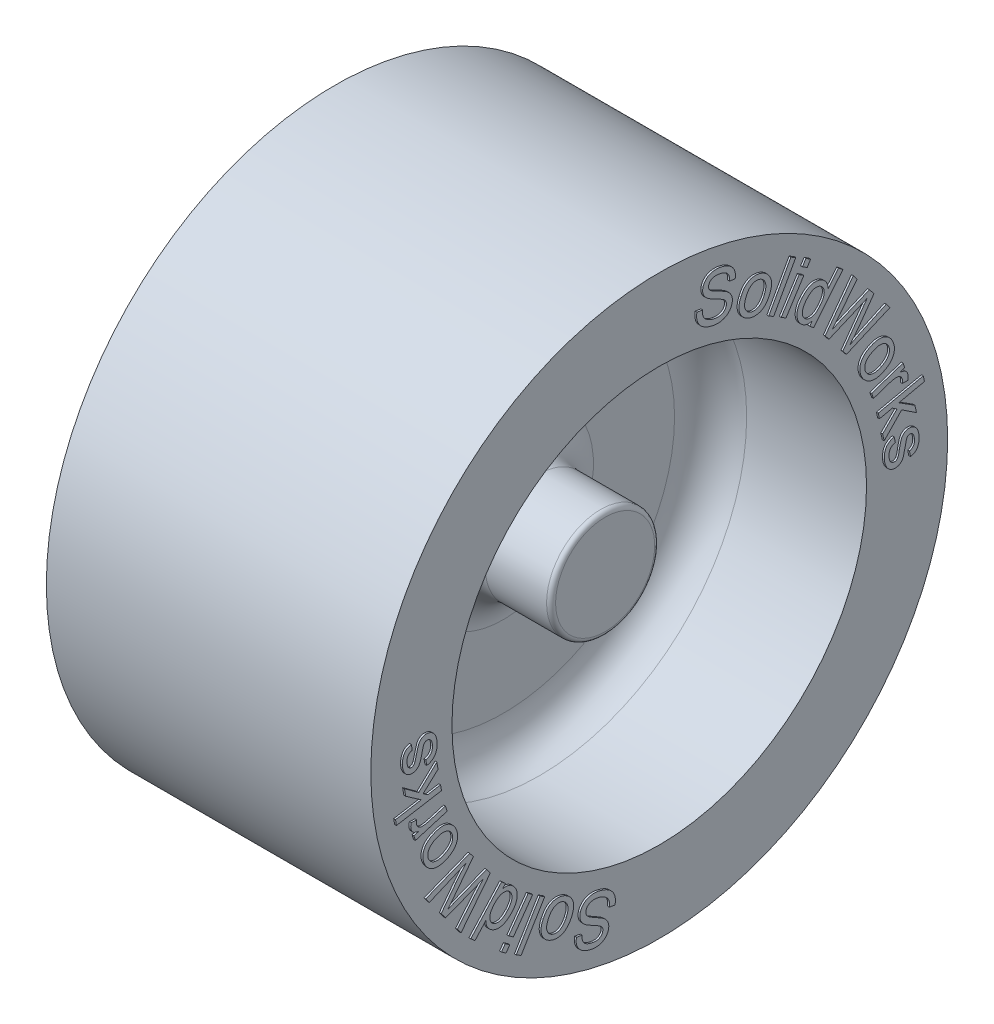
from build123d import *

# Parameters (mm, degrees)
SKETCH2_R           = 1.55
CUT_EXTRUDE1_DEPTH  = 15
BOSS_EXTRUDE1_DEPTH = 0.1


with BuildPart() as part:
    # Sketch1 → Revolve1 (revolve)
    with BuildSketch(Plane.XY, mode=Mode.PRIVATE) as revolve1_sk:
        with BuildLine():
            Line((14.647461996, 11.5), (14.647461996, 16))
            Line((14.647461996, 16), (-3.352538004, 16))
            Line((-3.352538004, 16), (-3.352538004, 14.25))
            Line((-3.352538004, 14.25), (11.147461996, 14.25))
            Line((11.147461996, 14.25), (11.147461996, 13))
            Line((11.147461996, 13), (4.397461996, 13))
            ThreePointArc((4.397461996, 13), (2.983248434, 12.414213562), (2.397461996, 11))
            Line((2.397461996, 11), (2.397461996, 5))
            ThreePointArc((2.397461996, 5), (2.324238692, 4.823223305), (2.147461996, 4.75))
            Line((2.147461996, 4.75), (0.647461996, 4.75))
            ThreePointArc((0.647461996, 4.75), (0.470685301, 4.676776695), (0.397461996, 4.5))
            Line((0.397461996, 4.5), (0.397461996, 3.375))
            ThreePointArc((0.397461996, 3.375), (0.324238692, 3.198223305), (0.147461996, 3.125))
            Line((0.147461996, 3.125), (-4.352538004, 3.125))
            Line((-4.352538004, 3.125), (-4.352538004, 0))
            Line((-4.352538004, 0), (11.647461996, 0))
            Line((11.647461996, 0), (11.647461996, 2.75))
            ThreePointArc((11.647461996, 2.75), (11.574238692, 2.926776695), (11.397461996, 3))
            Line((11.397461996, 3), (7.997461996, 3))
            ThreePointArc((7.997461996, 3), (6.583248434, 3.585786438), (5.997461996, 5))
            Line((5.997461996, 5), (5.997461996, 9.5))
            ThreePointArc((5.997461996, 9.5), (6.583248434, 10.914213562), (7.997461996, 11.5))
            Line((7.997461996, 11.5), (14.647461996, 11.5))
        make_face()
    revolve(revolve1_sk.sketch.rotate(Axis((0, 0, 0), (1, 0, 0)), 90), axis=Axis((0, 0, 0), (1, 0, 0)))

    # Sketch2 → Cut-Extrude1 (cut)
    with BuildSketch(Plane.ZY.offset(4.352538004)):
        Circle(SKETCH2_R)
    extrude(amount=-CUT_EXTRUDE1_DEPTH, mode=Mode.SUBTRACT)

    # Sketch3 → Boss-Extrude1 (add)
    # profile 1 of 22: a face of its own
    with BuildSketch(Plane(origin=(14.647461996, 0, 0), x_dir=(0, 0, -1), z_dir=(1, 0, 0))):
        with BuildLine():
            Line((12.931649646, 1.696638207), (13.000076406, 1.391032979))
            add(Edge.make_bspline(
                [(13.000076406, 1.391032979), (12.985077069, 1.387719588), (12.955768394, 1.381245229), (12.914187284, 1.366936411), (12.875078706, 1.35116935), (12.838975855, 1.332153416), (12.805966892, 1.309942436), (12.775932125, 1.284998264), (12.748524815, 1.257774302), (12.724236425, 1.22774254), (12.70294804, 1.195036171), (12.684779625, 1.15941801), (12.67070753, 1.120765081), (12.65922379, 1.079680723), (12.650922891, 1.035805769), (12.646655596, 0.988974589), (12.644821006, 0.939467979), (12.646692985, 0.905696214), (12.647652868, 0.888379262)],
                knots=[0, 0, 0, 0, 1.07921642, 2.108786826, 3.08738218, 4.042136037, 4.971890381, 5.879725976, 6.783548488, 7.683743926, 8.590136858, 9.523091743, 10.488447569, 11.477315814, 12.520286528, 13.622961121, 14.781139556, 16, 16, 16, 16], degree=3))
            add(Edge.make_bspline(
                [(12.647652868, 0.888379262), (12.648980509, 0.871035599), (12.651552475, 0.837436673), (12.658821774, 0.788976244), (12.668393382, 0.744225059), (12.680811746, 0.703092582), (12.695792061, 0.665674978), (12.712343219, 0.631236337), (12.732938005, 0.601318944), (12.761510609, 0.566446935), (12.801349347, 0.53085749), (12.85446052, 0.501730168), (12.910386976, 0.483417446), (12.948834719, 0.483800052), (12.968178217, 0.483992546)],
                knots=[0, 0, 0, 0, 1.084994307, 2.101899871, 3.05475144, 3.938208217, 4.778695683, 5.568260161, 6.31612126, 7.038121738, 8.379909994, 9.615623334, 10.800392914, 12, 12, 12, 12], degree=3))
            add(Edge.make_bspline(
                [(12.968178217, 0.483992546), (12.985084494, 0.485920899), (13.017963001, 0.489671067), (13.062348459, 0.511936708), (13.101393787, 0.543400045), (13.119348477, 0.571997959), (13.128698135, 0.586889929)],
                knots=[0, 0, 0, 0, 1.017674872, 1.979124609, 2.947656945, 4, 4, 4, 4], degree=3))
            add(Edge.make_bspline(
                [(13.128698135, 0.586889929), (13.132099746, 0.593342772), (13.139783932, 0.607919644), (13.149003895, 0.634035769), (13.159465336, 0.665841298), (13.169372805, 0.703931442), (13.180178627, 0.747660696), (13.191708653, 0.797324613), (13.202683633, 0.853176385), (13.210178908, 0.892491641), (13.214102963, 0.913074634)],
                knots=[0, 0, 0, 0, 0.517166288, 1.168270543, 1.96128169, 2.894390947, 3.960191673, 5.159076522, 6.512671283, 8, 8, 8, 8], degree=3))
            add(Edge.make_bspline(
                [(13.214102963, 0.913074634), (13.219331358, 0.941045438), (13.229417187, 0.995002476), (13.245334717, 1.072328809), (13.260924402, 1.143124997), (13.275434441, 1.207244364), (13.290607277, 1.264606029), (13.304865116, 1.315419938), (13.318530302, 1.359831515), (13.336726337, 1.409353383), (13.362245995, 1.46366291), (13.399760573, 1.521195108), (13.44372605, 1.571247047), (13.494601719, 1.612879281), (13.550097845, 1.647065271), (13.609867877, 1.672199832), (13.67298002, 1.689897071), (13.716645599, 1.694363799), (13.738879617, 1.696638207)],
                knots=[0, 0, 0, 0, 1.322271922, 2.550726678, 3.668384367, 4.690998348, 5.605277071, 6.425181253, 7.143520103, 7.763792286, 8.875953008, 9.923659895, 10.945497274, 11.958721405, 12.967390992, 13.963579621, 14.963077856, 16, 16, 16, 16], degree=3))
            add(Edge.make_bspline(
                [(13.738879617, 1.696638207), (13.759126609, 1.697321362), (13.79906032, 1.698668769), (13.858452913, 1.691770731), (13.915721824, 1.677151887), (13.970890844, 1.655923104), (14.023333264, 1.628856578), (14.071786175, 1.595587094), (14.116775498, 1.557513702), (14.14259601, 1.52789788), (14.155614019, 1.512966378)],
                knots=[0, 0, 0, 0, 1.026913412, 2.025410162, 3.02162897, 4.018797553, 5.019112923, 6.008734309, 6.996057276, 8, 8, 8, 8], degree=3))
            add(Edge.make_bspline(
                [(14.155614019, 1.512966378), (14.165307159, 1.50045932), (14.185655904, 1.474203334), (14.212319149, 1.428947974), (14.236431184, 1.376733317), (14.260250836, 1.319153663), (14.280511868, 1.256750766), (14.296345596, 1.190844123), (14.308647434, 1.122508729), (14.312250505, 1.075701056), (14.314075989, 1.051986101)],
                knots=[0, 0, 0, 0, 0.767508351, 1.611225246, 2.542097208, 3.557696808, 4.634367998, 5.722594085, 6.846159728, 8, 8, 8, 8], degree=3))
            add(Edge.make_bspline(
                [(14.314075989, 1.051986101), (14.315781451, 1.01682973), (14.319086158, 0.948706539), (14.312774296, 0.849064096), (14.300195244, 0.755369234), (14.278042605, 0.668492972), (14.248828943, 0.58996318), (14.214428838, 0.520122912), (14.172295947, 0.461128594), (14.123325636, 0.411825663), (14.066091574, 0.371810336), (14.000707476, 0.337607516), (13.926086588, 0.308912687), (13.872298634, 0.295133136), (13.844349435, 0.287973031)],
                knots=[0, 0, 0, 0, 1.270356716, 2.461595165, 3.600386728, 4.680561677, 5.691907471, 6.622689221, 7.483884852, 8.298558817, 9.120150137, 9.995727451, 10.95854355, 12, 12, 12, 12], degree=3))
            Line((13.844349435, 0.287973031), (13.782611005, 0.591005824))
            add(Edge.make_bspline(
                [(13.782611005, 0.591005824), (13.805047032, 0.596645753), (13.848449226, 0.607556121), (13.906920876, 0.637981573), (13.957702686, 0.676321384), (13.998837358, 0.725280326), (14.03089868, 0.783675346), (14.051701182, 0.852052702), (14.061127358, 0.929974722), (14.059326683, 0.984573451), (14.058375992, 1.013399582)],
                knots=[0, 0, 0, 0, 0.991087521, 1.917245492, 2.810537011, 3.709827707, 4.64325825, 5.654875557, 6.761860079, 8, 8, 8, 8], degree=3))
            add(Edge.make_bspline(
                [(14.058375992, 1.013399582), (14.056945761, 1.03072953), (14.054192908, 1.064085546), (14.048400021, 1.112113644), (14.039413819, 1.155825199), (14.029293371, 1.195776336), (14.017143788, 1.231855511), (14.002612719, 1.263759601), (13.986957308, 1.292217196), (13.962391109, 1.322649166), (13.930262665, 1.354392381), (13.887334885, 1.381413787), (13.841496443, 1.397243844), (13.81016819, 1.397219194), (13.794444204, 1.397206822)],
                knots=[0, 0, 0, 0, 1.205879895, 2.321031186, 3.351893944, 4.297984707, 5.178013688, 5.987038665, 6.727518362, 7.422174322, 8.692201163, 9.840591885, 10.916169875, 12, 12, 12, 12], degree=3))
            add(Edge.make_bspline(
                [(13.794444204, 1.397206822), (13.784584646, 1.39622985), (13.76497476, 1.394286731), (13.737204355, 1.384391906), (13.710637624, 1.371272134), (13.695599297, 1.358455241), (13.687945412, 1.351931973)],
                knots=[0, 0, 0, 0, 1.004303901, 1.997481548, 2.980801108, 4, 4, 4, 4], degree=3))
            add(Edge.make_bspline(
                [(13.687945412, 1.351931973), (13.680139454, 1.344267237), (13.664065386, 1.328483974), (13.644025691, 1.299230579), (13.625813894, 1.265387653), (13.616941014, 1.24009565), (13.612315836, 1.226911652)],
                knots=[0, 0, 0, 0, 0.886779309, 1.826060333, 2.866787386, 4, 4, 4, 4], degree=3))
            add(Edge.make_bspline(
                [(13.612315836, 1.226911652), (13.610920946, 1.221944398), (13.607614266, 1.210169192), (13.602508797, 1.189401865), (13.596429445, 1.162796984), (13.589233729, 1.130381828), (13.581017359, 1.092306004), (13.571773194, 1.048570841), (13.561423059, 0.999020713), (13.554330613, 0.964012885), (13.550577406, 0.945487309)],
                knots=[0, 0, 0, 0, 0.429689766, 1.018608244, 1.780864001, 2.702667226, 3.784060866, 5.025071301, 6.42571589, 8, 8, 8, 8], degree=3))
            add(Edge.make_bspline(
                [(13.550577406, 0.945487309), (13.545133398, 0.918382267), (13.534649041, 0.866181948), (13.5188582, 0.791197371), (13.503129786, 0.72270295), (13.489157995, 0.660258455), (13.474519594, 0.604485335), (13.461316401, 0.554822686), (13.448466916, 0.51158029), (13.432535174, 0.462950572), (13.409992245, 0.408902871), (13.375022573, 0.351254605), (13.333647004, 0.299873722), (13.285606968, 0.254979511), (13.229787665, 0.218531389), (13.166761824, 0.191370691), (13.096747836, 0.172383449), (13.047358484, 0.167532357), (13.021684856, 0.165010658)],
                knots=[0, 0, 0, 0, 1.280754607, 2.46654479, 3.549741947, 4.536457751, 5.430549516, 6.220721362, 6.917008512, 7.519971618, 8.591333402, 9.621395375, 10.632626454, 11.638977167, 12.654816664, 13.704304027, 14.806648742, 16, 16, 16, 16], degree=3))
            add(Edge.make_bspline(
                [(13.021684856, 0.165010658), (12.995915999, 0.164338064), (12.944390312, 0.16299319), (12.867698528, 0.176197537), (12.792491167, 0.200153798), (12.719928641, 0.235689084), (12.651073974, 0.281590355), (12.590039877, 0.340102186), (12.534869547, 0.407775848), (12.488473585, 0.486411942), (12.450349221, 0.573093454), (12.420259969, 0.666465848), (12.399456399, 0.766174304), (12.39346998, 0.835122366), (12.39040941, 0.87037222)],
                knots=[0, 0, 0, 0, 0.876130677, 1.751852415, 2.634790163, 3.556906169, 4.494868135, 5.441086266, 6.425333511, 7.460068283, 8.539989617, 9.644553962, 10.795772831, 12, 12, 12, 12], degree=3))
            add(Edge.make_bspline(
                [(12.39040941, 0.87037222), (12.389058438, 0.899519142), (12.38643653, 0.95608621), (12.38791669, 1.038572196), (12.394359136, 1.11597487), (12.406349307, 1.188327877), (12.422351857, 1.255807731), (12.444202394, 1.318152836), (12.470801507, 1.375562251), (12.503019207, 1.42784179), (12.539975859, 1.475735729), (12.581736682, 1.519492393), (12.628287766, 1.559298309), (12.679734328, 1.594974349), (12.735851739, 1.626862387), (12.796847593, 1.65457302), (12.862365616, 1.678457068), (12.908215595, 1.690488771), (12.931649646, 1.696638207)],
                knots=[0, 0, 0, 0, 1.277883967, 2.480061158, 3.611128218, 4.676946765, 5.689991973, 6.645087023, 7.565916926, 8.456210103, 9.329220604, 10.211266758, 11.101052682, 12.007583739, 12.949619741, 13.924481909, 14.939196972, 16, 16, 16, 16], degree=3))
        make_face()
    # profile 2 of 22: a face of its own
    with BuildSketch(Plane(origin=(14.647461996, 0, 0), x_dir=(0, 0, -1), z_dir=(1, 0, 0))):
        Polygon((12.048459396, 3.274680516), (14.54680786, 3.81952216), (14.613691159, 3.512887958), (13.189076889, 3.202137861), (14.083769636, 2.63671674), (14.170203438, 2.239532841), (13.348053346, 2.784888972), (12.375673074, 1.774951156), (12.292840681, 2.153613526), (13.088237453, 2.95364068), (12.833051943, 3.124450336), (12.115342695, 2.968046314), align=None)
    # profile 3 of 22: a face of its own
    with BuildSketch(Plane(origin=(14.647461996, 0, 0), x_dir=(0, 0, -1), z_dir=(1, 0, 0))):
        with BuildLine():
            Line((11.685070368, 4.40907581), (13.426608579, 4.991474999))
            Line((13.426608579, 4.991474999), (13.515100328, 4.72599975))
            Line((13.515100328, 4.72599975), (13.25116854, 4.638022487))
            add(Edge.make_bspline(
                [(13.25116854, 4.638022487), (13.268857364, 4.63471716), (13.302985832, 4.628339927), (13.351768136, 4.617145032), (13.396293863, 4.604597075), (13.436818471, 4.591828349), (13.473677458, 4.578769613), (13.505898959, 4.563860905), (13.534028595, 4.548265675), (13.566119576, 4.527384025), (13.600077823, 4.497217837), (13.63428404, 4.456810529), (13.662531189, 4.411947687), (13.674969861, 4.378980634), (13.681279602, 4.3622575)],
                knots=[0, 0, 0, 0, 1.199456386, 2.314207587, 3.334898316, 4.282143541, 5.146503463, 5.939338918, 6.645517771, 7.289153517, 8.48822851, 9.656276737, 10.811104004, 12, 12, 12, 12], degree=3))
            add(Edge.make_bspline(
                [(13.681279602, 4.3622575), (13.688423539, 4.336693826), (13.702906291, 4.284869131), (13.710033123, 4.202161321), (13.705316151, 4.115274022), (13.693526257, 4.056886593), (13.687453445, 4.026812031)],
                knots=[0, 0, 0, 0, 0.936117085, 1.897770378, 2.917170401, 4, 4, 4, 4], degree=3))
            Line((13.687453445, 4.026812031), (13.379275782, 4.036587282))
            add(Edge.make_bspline(
                [(13.379275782, 4.036587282), (13.3832847, 4.057782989), (13.391062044, 4.098902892), (13.392880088, 4.160353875), (13.387328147, 4.219260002), (13.376438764, 4.256396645), (13.371043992, 4.274794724)],
                knots=[0, 0, 0, 0, 1.071519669, 2.078759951, 3.048187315, 4, 4, 4, 4], degree=3))
            add(Edge.make_bspline(
                [(13.371043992, 4.274794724), (13.365006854, 4.290283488), (13.353084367, 4.320871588), (13.326908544, 4.362591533), (13.293860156, 4.399125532), (13.25485161, 4.43019575), (13.211175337, 4.455733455), (13.162895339, 4.473245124), (13.111006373, 4.483794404), (13.075094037, 4.484736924), (13.056692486, 4.485219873)],
                knots=[0, 0, 0, 0, 0.982362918, 1.940026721, 2.896021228, 3.88528314, 4.88124108, 5.876888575, 6.912113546, 8, 8, 8, 8], degree=3))
            add(Edge.make_bspline(
                [(13.056692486, 4.485219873), (13.027319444, 4.483839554), (12.967983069, 4.481051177), (12.87829418, 4.467336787), (12.786775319, 4.447899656), (12.726251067, 4.428632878), (12.695522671, 4.418851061)],
                knots=[0, 0, 0, 0, 0.956883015, 1.932995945, 2.95057409, 4, 4, 4, 4], degree=3))
            Line((12.695522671, 4.418851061), (11.783851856, 4.11376032))
            Line((11.783851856, 4.11376032), (11.685070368, 4.40907581))
        make_face()
    # profile 4 of 22: a face of its own
    with BuildSketch(Plane(origin=(14.647461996, 0, 0), x_dir=(0, 0, -1), z_dir=(1, 0, 0))):
        with BuildLine():
            add(Edge.make_bspline(
                [(11.618066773, 6.685776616), (11.655528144, 6.702888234), (11.728129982, 6.736051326), (11.838205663, 6.77369668), (11.944468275, 6.799750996), (12.04716653, 6.814524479), (12.146296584, 6.818100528), (12.241925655, 6.808980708), (12.33432794, 6.789774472), (12.392297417, 6.76671953), (12.421180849, 6.755232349)],
                knots=[0, 0, 0, 0, 1.187402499, 2.301239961, 3.349873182, 4.339089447, 5.289343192, 6.203435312, 7.104857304, 8, 8, 8, 8], degree=3))
            add(Edge.make_bspline(
                [(12.421180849, 6.755232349), (12.444533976, 6.744130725), (12.490900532, 6.722088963), (12.556614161, 6.682294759), (12.617481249, 6.636276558), (12.673861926, 6.58447124), (12.725788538, 6.52711774), (12.774048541, 6.46461017), (12.817435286, 6.396028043), (12.841935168, 6.346957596), (12.854378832, 6.322034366)],
                knots=[0, 0, 0, 0, 0.990461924, 1.966516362, 2.937846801, 3.909977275, 4.896244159, 5.899185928, 6.932981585, 8, 8, 8, 8], degree=3))
            add(Edge.make_bspline(
                [(12.854378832, 6.322034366), (12.866877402, 6.293936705), (12.891482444, 6.238622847), (12.919269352, 6.153730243), (12.937935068, 6.069280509), (12.948108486, 5.985502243), (12.948229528, 5.902211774), (12.940881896, 5.819364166), (12.923443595, 5.737190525), (12.89794656, 5.656052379), (12.863445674, 5.577396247), (12.820515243, 5.50224484), (12.768808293, 5.431443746), (12.708018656, 5.365285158), (12.63870902, 5.303530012), (12.561040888, 5.245772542), (12.475101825, 5.19201989), (12.41322807, 5.161182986), (12.381565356, 5.145402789)],
                knots=[0, 0, 0, 0, 1.03162645, 2.030889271, 2.991683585, 3.930504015, 4.85719546, 5.782151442, 6.71681641, 7.670672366, 8.632035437, 9.593674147, 10.569929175, 11.568064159, 12.603393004, 13.680869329, 14.813229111, 16, 16, 16, 16], degree=3))
            add(Edge.make_bspline(
                [(12.381565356, 5.145402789), (12.355411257, 5.133377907), (12.304515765, 5.109977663), (12.228904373, 5.079034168), (12.156172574, 5.053065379), (12.086112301, 5.0323647), (12.018769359, 5.016788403), (11.95411945, 5.006493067), (11.89242242, 5.000517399), (11.833216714, 5.000026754), (11.776121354, 5.004216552), (11.720632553, 5.012556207), (11.666378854, 5.02421216), (11.613459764, 5.040428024), (11.561748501, 5.060455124), (11.511058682, 5.084085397), (11.461970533, 5.112136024), (11.398620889, 5.154517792), (11.324289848, 5.214834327), (11.245775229, 5.298428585), (11.176991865, 5.391807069), (11.141268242, 5.460759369), (11.123130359, 5.495768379)],
                knots=[0, 0, 0, 0, 1.164968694, 2.267011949, 3.305402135, 4.289358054, 5.222164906, 6.100822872, 6.937232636, 7.728534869, 8.494059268, 9.251866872, 9.997949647, 10.737905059, 11.489392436, 12.240815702, 12.999290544, 13.775098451, 15.324197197, 16.861040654, 18.40626258, 20, 20, 20, 20], degree=3))
            add(Edge.make_bspline(
                [(11.123130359, 5.495768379), (11.110261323, 5.524368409), (11.085012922, 5.580480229), (11.056718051, 5.666640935), (11.03755935, 5.75194384), (11.026880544, 5.836383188), (11.025994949, 5.920058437), (11.033701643, 6.002837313), (11.05030637, 6.084797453), (11.075954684, 6.16544678), (11.110998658, 6.243893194), (11.155643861, 6.318902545), (11.209429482, 6.390180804), (11.272829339, 6.457507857), (11.345783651, 6.520530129), (11.427436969, 6.580595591), (11.518871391, 6.636161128), (11.584374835, 6.668924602), (11.618066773, 6.685776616)],
                knots=[0, 0, 0, 0, 1.030874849, 2.022524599, 2.976238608, 3.902456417, 4.816209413, 5.722569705, 6.631785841, 7.561089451, 8.500250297, 9.451074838, 10.425673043, 11.431179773, 12.486481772, 13.591983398, 14.761427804, 16, 16, 16, 16], degree=3))
        make_face()
        with BuildLine():
            add(Edge.make_bspline(
                [(11.755949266, 6.397149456), (11.730410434, 6.384414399), (11.680993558, 6.359772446), (11.611749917, 6.31908768), (11.549685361, 6.276254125), (11.494362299, 6.231637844), (11.446189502, 6.184701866), (11.405127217, 6.135680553), (11.371563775, 6.084429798), (11.344598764, 6.031827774), (11.324556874, 5.978210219), (11.310763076, 5.924537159), (11.301968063, 5.871152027), (11.300786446, 5.817582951), (11.304881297, 5.764153), (11.314475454, 5.710692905), (11.331393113, 5.657738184), (11.346446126, 5.623405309), (11.354134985, 5.605868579)],
                knots=[0, 0, 0, 0, 1.368133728, 2.647297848, 3.8471373, 4.981176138, 6.051152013, 7.067185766, 8.041081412, 8.982567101, 9.895944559, 10.779517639, 11.636674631, 12.4840325, 13.341780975, 14.203069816, 15.082154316, 16, 16, 16, 16], degree=3))
            add(Edge.make_bspline(
                [(11.354134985, 5.605868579), (11.362667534, 5.589007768), (11.379457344, 5.555830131), (11.410967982, 5.510551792), (11.445111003, 5.468897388), (11.484399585, 5.432739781), (11.526933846, 5.400628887), (11.573968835, 5.373821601), (11.624553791, 5.351044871), (11.679144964, 5.333073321), (11.737208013, 5.320414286), (11.798734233, 5.31576753), (11.863201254, 5.316603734), (11.930939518, 5.325115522), (12.001474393, 5.341051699), (12.075492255, 5.362700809), (12.152483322, 5.391520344), (12.203869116, 5.415172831), (12.230306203, 5.427341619)],
                knots=[0, 0, 0, 0, 0.898395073, 1.767805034, 2.619600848, 3.457038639, 4.302710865, 5.151175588, 6.028064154, 6.93927305, 7.88224938, 8.84891763, 9.869403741, 10.946682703, 12.09149067, 13.308083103, 14.615056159, 16, 16, 16, 16], degree=3))
            add(Edge.make_bspline(
                [(12.230306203, 5.427341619), (12.255050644, 5.439457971), (12.303028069, 5.462950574), (12.369312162, 5.503802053), (12.430091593, 5.54484846), (12.483186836, 5.589639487), (12.530389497, 5.635608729), (12.570268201, 5.684368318), (12.60357996, 5.734986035), (12.629733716, 5.787660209), (12.649817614, 5.841126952), (12.663940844, 5.894755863), (12.671384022, 5.948274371), (12.674573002, 6.001554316), (12.669981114, 6.05469973), (12.660351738, 6.107535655), (12.644198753, 6.159931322), (12.629372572, 6.193718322), (12.621830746, 6.210905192)],
                knots=[0, 0, 0, 0, 1.340612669, 2.599337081, 3.787541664, 4.907947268, 5.976630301, 6.99123165, 7.968556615, 8.920769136, 9.848204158, 10.745376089, 11.614482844, 12.475530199, 13.338155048, 14.204489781, 15.086654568, 16, 16, 16, 16], degree=3))
            add(Edge.make_bspline(
                [(12.621830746, 6.210905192), (12.613074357, 6.227901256), (12.595882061, 6.261271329), (12.564740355, 6.307415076), (12.529603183, 6.34870864), (12.490838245, 6.385528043), (12.448130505, 6.417640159), (12.401802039, 6.445734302), (12.350987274, 6.468102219), (12.297008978, 6.486319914), (12.239563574, 6.49862207), (12.179013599, 6.50500675), (12.115349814, 6.503557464), (12.048876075, 6.495747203), (11.979558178, 6.481043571), (11.907407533, 6.459681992), (11.832094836, 6.4318844), (11.781874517, 6.408975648), (11.755949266, 6.397149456)],
                knots=[0, 0, 0, 0, 0.918165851, 1.802726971, 2.667998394, 3.51910419, 4.366290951, 5.231248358, 6.116538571, 7.028656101, 7.96455106, 8.933812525, 9.947596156, 11.017854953, 12.146006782, 13.348212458, 14.631066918, 16, 16, 16, 16], degree=3))
        make_face(mode=Mode.SUBTRACT)
    # profile 5 of 22: a face of its own
    with BuildSketch(Plane(origin=(14.647461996, 0, 0), x_dir=(0, 0, -1), z_dir=(1, 0, 0))):
        with BuildLine():
            Line((9.103662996, 8.459152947), (10.662558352, 10.570092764))
            Line((10.662558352, 10.570092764), (10.877613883, 10.301530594))
            Line((10.877613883, 10.301530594), (9.820857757, 8.961292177))
            add(Edge.make_bspline(
                [(9.820857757, 8.961292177), (9.765866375, 8.891362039), (9.656582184, 8.752390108), (9.540506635, 8.619038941), (9.482839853, 8.552789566)],
                knots=[0, 0, 0, 0, 1.00639226, 2, 2, 2, 2], degree=3))
            add(Edge.make_bspline(
                [(9.482839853, 8.552789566), (9.512685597, 8.566840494), (9.569115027, 8.593406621), (9.648576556, 8.631032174), (9.718438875, 8.663288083), (9.777868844, 8.691773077), (9.827597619, 8.714943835), (9.867638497, 8.732738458), (9.897172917, 8.746960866), (9.9139625, 8.754163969), (9.920668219, 8.757040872)],
                knots=[0, 0, 0, 0, 1.63867408, 3.098245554, 4.367385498, 5.461048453, 6.371990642, 7.092544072, 7.637564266, 8, 8, 8, 8], degree=3))
            Line((9.920668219, 8.757040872), (11.559309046, 9.450569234))
            Line((11.559309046, 9.450569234), (11.811922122, 9.134674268))
            Line((11.811922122, 9.134674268), (11.037619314, 8.048592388))
            add(Edge.make_bspline(
                [(11.037619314, 8.048592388), (10.989981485, 7.982797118), (10.896471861, 7.853645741), (10.752428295, 7.668474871), (10.608127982, 7.494983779), (10.508631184, 7.386250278), (10.459850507, 7.332941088)],
                knots=[0, 0, 0, 0, 1.058971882, 2.078685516, 3.058029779, 4, 4, 4, 4], degree=3))
            add(Edge.make_bspline(
                [(10.459850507, 7.332941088), (10.497726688, 7.352196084), (10.576213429, 7.392096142), (10.698678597, 7.453154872), (10.831091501, 7.515538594), (10.922524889, 7.55798915), (10.969707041, 7.579894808)],
                knots=[0, 0, 0, 0, 0.899944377, 1.864858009, 2.898207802, 4, 4, 4, 4], degree=3))
            Line((10.969707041, 7.579894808), (12.490530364, 8.287828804))
            Line((12.490530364, 8.287828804), (12.70147, 8.024411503))
            Line((12.70147, 8.024411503), (10.286982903, 6.981546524))
            Line((10.286982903, 6.981546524), (10.084275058, 7.2341596))
            Line((10.084275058, 7.2341596), (11.258848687, 8.859423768))
            add(Edge.make_bspline(
                [(11.258848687, 8.859423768), (11.270491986, 8.87572906), (11.292481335, 8.906522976), (11.324019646, 8.950096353), (11.35252183, 8.988285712), (11.376256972, 9.022469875), (11.397601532, 9.050934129), (11.415590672, 9.07418022), (11.429309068, 9.093101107), (11.437851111, 9.103492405), (11.441491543, 9.107920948)],
                knots=[0, 0, 0, 0, 1.559032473, 2.944363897, 4.185481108, 5.266721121, 6.182162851, 6.953497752, 7.554003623, 8, 8, 8, 8], degree=3))
            add(Edge.make_bspline(
                [(11.441491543, 9.107920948), (11.415417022, 9.095588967), (11.365347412, 9.071908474), (11.293118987, 9.037442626), (11.226081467, 9.007404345), (11.183063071, 8.98869579), (11.162639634, 8.979813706)],
                knots=[0, 0, 0, 0, 1.127836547, 2.165728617, 3.12916031, 4, 4, 4, 4], degree=3))
            Line((11.162639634, 8.979813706), (9.317689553, 8.191619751))
            Line((9.317689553, 8.191619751), (9.103662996, 8.459152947))
        make_face()
    # profile 6 of 22: a face of its own
    with BuildSketch(Plane(origin=(14.647461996, 0, 0), x_dir=(0, 0, -1), z_dir=(1, 0, 0))):
        with BuildLine():
            Line((8.24041693, 9.357610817), (8.388589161, 9.538710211))
            add(Edge.make_bspline(
                [(8.388589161, 9.538710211), (8.363024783, 9.53115243), (8.313030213, 9.516372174), (8.236615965, 9.506387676), (8.161937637, 9.50564368), (8.088479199, 9.514916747), (8.016547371, 9.534787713), (7.946152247, 9.564556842), (7.87692404, 9.603739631), (7.834264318, 9.63692083), (7.812363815, 9.65395528)],
                knots=[0, 0, 0, 0, 1.038324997, 2.03058376, 2.993742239, 3.944465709, 4.908274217, 5.894563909, 6.919118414, 8, 8, 8, 8], degree=3))
            add(Edge.make_bspline(
                [(7.812363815, 9.65395528), (7.798456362, 9.665753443), (7.770764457, 9.689245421), (7.732847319, 9.727892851), (7.698257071, 9.768751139), (7.666648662, 9.811631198), (7.638359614, 9.856823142), (7.613583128, 9.904543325), (7.591946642, 9.954348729), (7.574001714, 10.006323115), (7.559747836, 10.059652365), (7.548709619, 10.113904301), (7.542079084, 10.16878925), (7.539647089, 10.224323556), (7.540512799, 10.280542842), (7.545854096, 10.337405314), (7.554565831, 10.395004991), (7.571923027, 10.472984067), (7.603650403, 10.570737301), (7.656956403, 10.685578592), (7.724462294, 10.799250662), (7.779819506, 10.870262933), (7.80824792, 10.906730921)],
                knots=[0, 0, 0, 0, 0.780775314, 1.554645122, 2.315473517, 3.072035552, 3.834245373, 4.596419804, 5.372795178, 6.15791142, 6.948983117, 7.735472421, 8.527157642, 9.313921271, 10.114651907, 10.933239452, 11.758031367, 12.608076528, 14.352474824, 16.146920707, 18.021270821, 20, 20, 20, 20], degree=3))
            add(Edge.make_bspline(
                [(7.80824792, 10.906730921), (7.837804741, 10.941102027), (7.895700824, 11.008428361), (7.991585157, 11.097639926), (8.091781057, 11.174987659), (8.179686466, 11.229299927), (8.251985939, 11.265145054), (8.306107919, 11.287849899), (8.360159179, 11.306576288), (8.414514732, 11.320587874), (8.46907284, 11.329886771), (8.523805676, 11.334411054), (8.57849239, 11.334962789), (8.633012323, 11.331348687), (8.687032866, 11.323681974), (8.739962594, 11.311789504), (8.791671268, 11.296214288), (8.842216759, 11.27735184), (8.891122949, 11.254026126), (8.938603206, 11.22701185), (8.985219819, 11.196919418), (9.014392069, 11.173662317), (9.029125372, 11.161916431)],
                knots=[0, 0, 0, 0, 1.937522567, 3.795231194, 5.589347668, 7.344114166, 8.203494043, 9.038491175, 9.852611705, 10.647779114, 11.436357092, 12.216602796, 12.994085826, 13.773227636, 14.551160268, 15.325210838, 16.090946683, 16.85924241, 17.630229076, 18.40532139, 19.194615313, 20, 20, 20, 20], degree=3))
            add(Edge.make_bspline(
                [(9.029125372, 11.161916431), (9.049599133, 11.143997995), (9.089654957, 11.10894153), (9.141806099, 11.04993169), (9.183544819, 10.986029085), (9.216623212, 10.91910386), (9.240476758, 10.849959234), (9.257389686, 10.780427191), (9.265291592, 10.710376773), (9.264250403, 10.663905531), (9.263731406, 10.640741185)],
                knots=[0, 0, 0, 0, 1.099184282, 2.1504955, 3.171517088, 4.17607142, 5.160545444, 6.12239962, 7.064079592, 8, 8, 8, 8], degree=3))
            Line((9.263731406, 10.640741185), (9.845101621, 11.35073313))
            Line((9.845101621, 11.35073313), (10.086395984, 11.153170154))
            Line((10.086395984, 11.153170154), (8.465762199, 9.173424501))
            Line((8.465762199, 9.173424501), (8.24041693, 9.357610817))
        make_face()
        with BuildLine():
            add(Edge.make_bspline(
                [(8.057774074, 10.702479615), (8.039753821, 10.680105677), (8.004837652, 10.63675378), (7.95988302, 10.569375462), (7.920561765, 10.504265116), (7.889837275, 10.43959838), (7.865271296, 10.376797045), (7.847852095, 10.315337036), (7.838649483, 10.25502516), (7.835924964, 10.19652686), (7.839909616, 10.140240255), (7.847704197, 10.086728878), (7.861188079, 10.036553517), (7.879443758, 9.989707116), (7.901921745, 9.945876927), (7.929550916, 9.905280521), (7.962056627, 9.867962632), (7.987024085, 9.846099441), (7.999637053, 9.835054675)],
                knots=[0, 0, 0, 0, 1.416585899, 2.744786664, 3.99268064, 5.165797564, 6.271955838, 7.316779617, 8.309970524, 9.275421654, 10.199541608, 11.089810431, 11.9394722, 12.756491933, 13.56629528, 14.364165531, 15.173615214, 16, 16, 16, 16], degree=3))
            add(Edge.make_bspline(
                [(7.999637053, 9.835054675), (8.01296186, 9.824779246), (8.039322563, 9.804451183), (8.082360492, 9.779995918), (8.126820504, 9.75987751), (8.173667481, 9.746378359), (8.221987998, 9.736524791), (8.272297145, 9.734118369), (8.324157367, 9.735345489), (8.377630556, 9.742717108), (8.432347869, 9.7558575), (8.487029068, 9.776940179), (8.542172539, 9.804387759), (8.596848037, 9.839624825), (8.651937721, 9.881558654), (8.706063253, 9.931517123), (8.761511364, 9.987265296), (8.796196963, 10.028739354), (8.814069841, 10.050110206)],
                knots=[0, 0, 0, 0, 0.852679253, 1.686870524, 2.504889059, 3.322398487, 4.155091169, 5.000638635, 5.871065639, 6.784064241, 7.73363942, 8.719355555, 9.750448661, 10.853473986, 12.014148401, 13.258390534, 14.587296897, 16, 16, 16, 16], degree=3))
            add(Edge.make_bspline(
                [(8.814069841, 10.050110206), (8.833210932, 10.074079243), (8.870196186, 10.120393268), (8.919388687, 10.1910692), (8.960400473, 10.260047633), (8.995038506, 10.326564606), (9.021349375, 10.391355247), (9.040185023, 10.454225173), (9.051957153, 10.51507991), (9.055280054, 10.574010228), (9.052867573, 10.630406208), (9.044438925, 10.683943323), (9.031757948, 10.734736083), (9.013736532, 10.782538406), (8.989869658, 10.827056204), (8.960594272, 10.868274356), (8.927292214, 10.907604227), (8.901006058, 10.930218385), (8.88764147, 10.941716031)],
                knots=[0, 0, 0, 0, 1.464395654, 2.829569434, 4.107523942, 5.294087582, 6.407172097, 7.440922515, 8.423833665, 9.359098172, 10.252599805, 11.114239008, 11.942427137, 12.748458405, 13.547093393, 14.346735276, 15.159435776, 16, 16, 16, 16], degree=3))
            add(Edge.make_bspline(
                [(8.88764147, 10.941716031), (8.874134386, 10.952136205), (8.847413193, 10.972750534), (8.804149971, 10.998026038), (8.758748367, 11.017212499), (8.711787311, 11.031025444), (8.663184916, 11.040171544), (8.612722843, 11.042279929), (8.560664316, 11.039835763), (8.507028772, 11.03145847), (8.452088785, 11.017238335), (8.3967335, 10.994683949), (8.341150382, 10.964423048), (8.284610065, 10.927215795), (8.228532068, 10.881646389), (8.171366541, 10.829195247), (8.113993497, 10.769041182), (8.076921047, 10.725148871), (8.057774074, 10.702479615)],
                knots=[0, 0, 0, 0, 0.842194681, 1.666121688, 2.467121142, 3.271340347, 4.080675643, 4.90360012, 5.760371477, 6.651879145, 7.580769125, 8.557793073, 9.596427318, 10.703217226, 11.896728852, 13.161972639, 14.534231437, 16, 16, 16, 16], degree=3))
        make_face(mode=Mode.SUBTRACT)
    # profile 7 of 22: a face of its own
    with BuildSketch(Plane(origin=(14.647461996, 0, 0), x_dir=(0, 0, -1), z_dir=(1, 0, 0))):
        Polygon((7.84328583, 12.412174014), (8.036732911, 12.715206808), (8.300150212, 12.546455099), (8.106703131, 12.243422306), align=None)
    # profile 8 of 22: a face of its own
    with BuildSketch(Plane(origin=(14.647461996, 0, 0), x_dir=(0, 0, -1), z_dir=(1, 0, 0))):
        Polygon((6.66562528, 10.570310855), (7.659099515, 12.124061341), (7.922516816, 11.955309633), (6.929042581, 10.401559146), align=None)
    # profile 9 of 22: a face of its own
    with BuildSketch(Plane(origin=(14.647461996, 0, 0), x_dir=(0, 0, -1), z_dir=(1, 0, 0))):
        Polygon((5.974269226, 10.975792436), (7.202349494, 13.191173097), (7.474513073, 13.039913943), (6.246432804, 10.824533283), align=None)
    # profile 10 of 22: a face of its own
    with BuildSketch(Plane(origin=(14.647461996, 0, 0), x_dir=(0, 0, -1), z_dir=(1, 0, 0))):
        with BuildLine():
            add(Edge.make_bspline(
                [(4.42532939, 12.66382108), (4.442052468, 12.701839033), (4.474422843, 12.775429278), (4.531286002, 12.877749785), (4.593002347, 12.969253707), (4.660744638, 13.048949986), (4.732158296, 13.119196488), (4.810290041, 13.176417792), (4.89283102, 13.223729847), (4.951649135, 13.245947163), (4.98097526, 13.257024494)],
                knots=[0, 0, 0, 0, 1.187860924, 2.299307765, 3.344572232, 4.340408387, 5.287808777, 6.203467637, 7.104266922, 8, 8, 8, 8], degree=3))
            add(Edge.make_bspline(
                [(4.98097526, 13.257024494), (5.005890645, 13.264531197), (5.055361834, 13.279436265), (5.131400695, 13.293296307), (5.208085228, 13.299238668), (5.28522501, 13.298902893), (5.362905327, 13.291063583), (5.440989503, 13.27584287), (5.519791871, 13.254034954), (5.571253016, 13.233824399), (5.597330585, 13.223582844)],
                knots=[0, 0, 0, 0, 0.989298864, 1.964320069, 2.93299156, 3.911563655, 4.894994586, 5.898071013, 6.93486244, 8, 8, 8, 8], degree=3))
            add(Edge.make_bspline(
                [(5.597330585, 13.223582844), (5.625693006, 13.210857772), (5.681336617, 13.18589273), (5.759313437, 13.140926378), (5.830283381, 13.090428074), (5.893961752, 13.033906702), (5.950926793, 12.972021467), (6.000457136, 12.904276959), (6.042864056, 12.831083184), (6.078362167, 12.753134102), (6.105671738, 12.670914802), (6.123755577, 12.585491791), (6.132406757, 12.497689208), (6.131945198, 12.407139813), (6.121131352, 12.31419602), (6.10212903, 12.218402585), (6.073007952, 12.120441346), (6.047643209, 12.055524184), (6.034644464, 12.022255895)],
                knots=[0, 0, 0, 0, 1.034332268, 2.029233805, 2.990868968, 3.929122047, 4.858474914, 5.785668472, 6.71686069, 7.669848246, 8.632093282, 9.595032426, 10.570397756, 11.563774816, 12.60338737, 13.680462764, 14.811299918, 16, 16, 16, 16], degree=3))
            add(Edge.make_bspline(
                [(6.034644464, 12.022255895), (6.023161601, 11.995766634), (6.000757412, 11.944083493), (5.965083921, 11.86998077), (5.927157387, 11.801920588), (5.888995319, 11.739114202), (5.849033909, 11.682146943), (5.808273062, 11.630484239), (5.765141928, 11.585182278), (5.721454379, 11.544536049), (5.675542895, 11.509583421), (5.628775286, 11.477761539), (5.579656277, 11.450716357), (5.529271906, 11.426802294), (5.47689179, 11.407235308), (5.422883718, 11.391377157), (5.367237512, 11.378831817), (5.291091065, 11.36821687), (5.194839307, 11.362956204), (5.079454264, 11.3735142), (4.964836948, 11.396942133), (4.891483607, 11.424765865), (4.854411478, 11.438827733)],
                knots=[0, 0, 0, 0, 1.159381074, 2.262065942, 3.300898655, 4.287174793, 5.211898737, 6.093857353, 6.926949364, 7.721458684, 8.487365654, 9.241854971, 9.991045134, 10.736617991, 11.479801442, 12.233787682, 12.995721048, 13.768072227, 15.319484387, 16.853974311, 18.410026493, 20, 20, 20, 20], degree=3))
            add(Edge.make_bspline(
                [(4.854411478, 11.438827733), (4.825527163, 11.45170594), (4.768983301, 11.476916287), (4.68983779, 11.522490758), (4.618067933, 11.573570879), (4.55330786, 11.62965106), (4.496285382, 11.691602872), (4.445929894, 11.758537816), (4.40387812, 11.831668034), (4.368530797, 11.909329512), (4.342425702, 11.99172702), (4.32531439, 12.077992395), (4.31765822, 12.167703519), (4.319873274, 12.260825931), (4.332167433, 12.357039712), (4.353435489, 12.456684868), (4.384466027, 12.559847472), (4.411448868, 12.628503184), (4.42532939, 12.66382108)],
                knots=[0, 0, 0, 0, 1.03226792, 2.020765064, 2.97649696, 3.905333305, 4.812905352, 5.721306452, 6.634803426, 7.562271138, 8.502768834, 9.45064127, 10.428739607, 11.437075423, 12.48669917, 13.591712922, 14.7611281, 16, 16, 16, 16], degree=3))
        make_face()
        with BuildLine():
            add(Edge.make_bspline(
                [(4.722702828, 12.54034422), (4.712030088, 12.513727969), (4.691319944, 12.462079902), (4.667499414, 12.384736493), (4.648706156, 12.311037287), (4.638190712, 12.24019411), (4.632878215, 12.172718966), (4.635763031, 12.10841056), (4.644086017, 12.047404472), (4.659793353, 11.990022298), (4.680898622, 11.936474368), (4.706763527, 11.886920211), (4.736635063, 11.841160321), (4.771375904, 11.799930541), (4.810194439, 11.762468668), (4.853777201, 11.72946978), (4.901721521, 11.700447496), (4.936208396, 11.684916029), (4.953707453, 11.677035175)],
                knots=[0, 0, 0, 0, 1.364767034, 2.648291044, 3.850405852, 4.982128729, 6.054314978, 7.067644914, 8.041107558, 8.979984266, 9.892791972, 10.776616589, 11.637202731, 12.489263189, 13.338187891, 14.200476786, 15.086900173, 16, 16, 16, 16], degree=3))
            add(Edge.make_bspline(
                [(4.953707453, 11.677035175), (4.971584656, 11.670126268), (5.006624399, 11.656584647), (5.060678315, 11.643235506), (5.114501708, 11.635838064), (5.168172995, 11.634982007), (5.221682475, 11.639492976), (5.27499728, 11.650478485), (5.328238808, 11.667671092), (5.381301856, 11.69081225), (5.433421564, 11.720504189), (5.483054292, 11.758154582), (5.530556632, 11.802557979), (5.575337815, 11.854555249), (5.6180792, 11.913470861), (5.658580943, 11.979633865), (5.697406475, 12.052699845), (5.719974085, 12.104915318), (5.73161167, 12.131841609)],
                knots=[0, 0, 0, 0, 0.904693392, 1.773220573, 2.623415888, 3.466166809, 4.303839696, 5.155500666, 6.031777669, 6.94243721, 7.886053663, 8.858278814, 9.878600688, 10.952489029, 12.094968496, 13.313621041, 14.614697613, 16, 16, 16, 16], degree=3))
            add(Edge.make_bspline(
                [(5.73161167, 12.131841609), (5.741932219, 12.157601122), (5.762000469, 12.20769035), (5.785006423, 12.282741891), (5.801711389, 12.354775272), (5.812372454, 12.423907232), (5.815914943, 12.490243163), (5.813616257, 12.553696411), (5.804478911, 12.614179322), (5.788274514, 12.671290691), (5.767125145, 12.725011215), (5.741545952, 12.774898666), (5.711467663, 12.820574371), (5.677295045, 12.861931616), (5.639165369, 12.899484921), (5.595801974, 12.931651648), (5.549061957, 12.961180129), (5.5148917, 12.976197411), (5.497520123, 12.983831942)],
                knots=[0, 0, 0, 0, 1.339325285, 2.604310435, 3.785323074, 4.907121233, 5.97680121, 6.987798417, 7.967945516, 8.922185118, 9.84779628, 10.75136949, 11.624026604, 12.482745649, 13.337623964, 14.200405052, 15.085116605, 16, 16, 16, 16], degree=3))
            add(Edge.make_bspline(
                [(5.497520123, 12.983831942), (5.479648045, 12.990768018), (5.444463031, 13.004423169), (5.389975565, 13.017439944), (5.335917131, 13.025694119), (5.281839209, 13.026387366), (5.228243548, 13.021760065), (5.174601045, 13.011626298), (5.121583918, 12.994049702), (5.068470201, 12.971818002), (5.016956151, 12.942349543), (4.967627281, 12.905884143), (4.920680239, 12.862281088), (4.876025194, 12.811701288), (4.833628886, 12.754231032), (4.794192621, 12.689452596), (4.75646628, 12.617824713), (4.734204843, 12.566739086), (4.722702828, 12.54034422)],
                knots=[0, 0, 0, 0, 0.912921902, 1.797282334, 2.664432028, 3.51484807, 4.36828472, 5.226095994, 6.110343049, 7.026042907, 7.96708568, 8.931837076, 9.944320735, 11.015694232, 12.143951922, 13.344229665, 14.627819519, 16, 16, 16, 16], degree=3))
        make_face(mode=Mode.SUBTRACT)
    # profile 11 of 22: a face of its own
    with BuildSketch(Plane(origin=(14.647461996, 0, 0), x_dir=(0, 0, -1), z_dir=(1, 0, 0))):
        with BuildLine():
            Line((1.991136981, 13.149519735), (2.306002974, 13.106302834))
            add(Edge.make_bspline(
                [(2.306002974, 13.106302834), (2.303426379, 13.075626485), (2.298462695, 13.016530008), (2.302409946, 12.930428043), (2.314044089, 12.850759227), (2.336365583, 12.777007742), (2.370396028, 12.708630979), (2.415527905, 12.643555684), (2.474278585, 12.582987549), (2.543436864, 12.525618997), (2.622744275, 12.473944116), (2.710715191, 12.430585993), (2.80549747, 12.393847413), (2.872241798, 12.376760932), (2.906409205, 12.368014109)],
                knots=[0, 0, 0, 0, 1.044892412, 2.012933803, 2.921029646, 3.774333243, 4.618577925, 5.505913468, 6.453809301, 7.47582306, 8.553722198, 9.661120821, 10.802693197, 12, 12, 12, 12], degree=3))
            add(Edge.make_bspline(
                [(2.906409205, 12.368014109), (2.936837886, 12.361577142), (2.996121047, 12.349036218), (3.084399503, 12.340793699), (3.168607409, 12.339203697), (3.248262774, 12.346439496), (3.322326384, 12.360789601), (3.38903003, 12.383509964), (3.448419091, 12.41275389), (3.499007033, 12.450123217), (3.541377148, 12.493091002), (3.576090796, 12.540331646), (3.601604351, 12.592425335), (3.61214054, 12.629354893), (3.617430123, 12.647894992)],
                knots=[0, 0, 0, 0, 1.31334755, 2.558750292, 3.740154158, 4.868063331, 5.932631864, 6.920424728, 7.83766315, 8.718981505, 9.564562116, 10.379266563, 11.186327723, 12, 12, 12, 12], degree=3))
            add(Edge.make_bspline(
                [(3.617430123, 12.647894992), (3.620984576, 12.666856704), (3.627957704, 12.704055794), (3.627356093, 12.760577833), (3.616711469, 12.815075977), (3.597431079, 12.868407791), (3.566926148, 12.920136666), (3.523959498, 12.969519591), (3.470642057, 13.019033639), (3.428686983, 13.048180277), (3.406490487, 13.06360042)],
                knots=[0, 0, 0, 0, 0.92363615, 1.811989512, 2.691156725, 3.575885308, 4.519628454, 5.552759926, 6.705278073, 8, 8, 8, 8], degree=3))
            add(Edge.make_bspline(
                [(3.406490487, 13.06360042), (3.397782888, 13.069321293), (3.378209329, 13.082181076), (3.344626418, 13.102049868), (3.303972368, 13.125195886), (3.256058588, 13.151323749), (3.201049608, 13.18089905), (3.138151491, 13.212224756), (3.068702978, 13.248242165), (2.993756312, 13.285284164), (2.918390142, 13.323222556), (2.847527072, 13.360887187), (2.782499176, 13.396216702), (2.724047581, 13.4300915), (2.671770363, 13.461982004), (2.625905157, 13.492291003), (2.586203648, 13.520913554), (2.562479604, 13.540254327), (2.551413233, 13.549276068)],
                knots=[0, 0, 0, 0, 0.507710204, 1.141266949, 1.901156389, 2.787656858, 3.800942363, 4.94473793, 6.211906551, 7.613586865, 9.019024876, 10.3238647, 11.524541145, 12.625516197, 13.616036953, 14.508506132, 15.304274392, 16, 16, 16, 16], degree=3))
            add(Edge.make_bspline(
                [(2.551413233, 13.549276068), (2.526998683, 13.571342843), (2.479704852, 13.614088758), (2.420184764, 13.68581506), (2.372469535, 13.760223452), (2.33818424, 13.838222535), (2.316376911, 13.918578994), (2.30683254, 14.00085004), (2.307595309, 14.084850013), (2.318492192, 14.140184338), (2.324010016, 14.168203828)],
                knots=[0, 0, 0, 0, 1.132993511, 2.19474053, 3.201566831, 4.170176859, 5.119350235, 6.05994601, 7.017620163, 8, 8, 8, 8], degree=3))
            add(Edge.make_bspline(
                [(2.324010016, 14.168203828), (2.332348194, 14.198712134), (2.348911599, 14.259315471), (2.39025848, 14.344694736), (2.443538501, 14.423905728), (2.497998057, 14.483696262), (2.546860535, 14.527346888), (2.586638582, 14.557248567), (2.628950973, 14.584112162), (2.673779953, 14.607604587), (2.720845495, 14.628675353), (2.770874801, 14.645056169), (2.822896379, 14.659957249), (2.896290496, 14.673953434), (2.991454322, 14.684810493), (3.108826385, 14.685514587), (3.2295186, 14.674968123), (3.309893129, 14.658622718), (3.350925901, 14.650278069)],
                knots=[0, 0, 0, 0, 1.192777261, 2.369396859, 3.564389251, 4.789065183, 5.413209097, 6.037790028, 6.666891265, 7.304509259, 7.948546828, 8.612387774, 9.291451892, 9.991578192, 11.43257875, 12.903378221, 14.419113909, 16, 16, 16, 16], degree=3))
            add(Edge.make_bspline(
                [(3.350925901, 14.650278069), (3.395241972, 14.639090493), (3.481619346, 14.617284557), (3.603852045, 14.571797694), (3.715498, 14.517142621), (3.80001624, 14.463392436), (3.861823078, 14.416671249), (3.903688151, 14.379231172), (3.942172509, 14.340227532), (3.977668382, 14.299587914), (4.008323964, 14.256191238), (4.035568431, 14.211199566), (4.060335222, 14.164825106), (4.086318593, 14.099844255), (4.11195657, 14.01622232), (4.126357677, 13.912013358), (4.12816244, 13.805145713), (4.117345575, 13.734063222), (4.111852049, 13.697962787)],
                knots=[0, 0, 0, 0, 1.60530287, 3.128929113, 4.573605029, 5.966308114, 6.641332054, 7.294478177, 7.9379882, 8.566189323, 9.188319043, 9.802279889, 10.414196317, 11.03310664, 12.259207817, 13.477165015, 14.718735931, 16, 16, 16, 16], degree=3))
            Line((4.111852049, 13.697962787), (3.791841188, 13.746324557))
            add(Edge.make_bspline(
                [(3.791841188, 13.746324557), (3.793945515, 13.765853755), (3.798054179, 13.803984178), (3.797550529, 13.860101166), (3.793960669, 13.913715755), (3.784429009, 13.964460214), (3.771284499, 14.012666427), (3.753039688, 14.058101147), (3.729840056, 14.100570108), (3.702365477, 14.140815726), (3.669781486, 14.177815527), (3.632261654, 14.212243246), (3.589295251, 14.24350035), (3.541201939, 14.27227683), (3.487992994, 14.298749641), (3.429233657, 14.321362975), (3.365674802, 14.342449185), (3.321009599, 14.353074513), (3.297933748, 14.358563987)],
                knots=[0, 0, 0, 0, 1.067271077, 2.083828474, 3.047321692, 3.985753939, 4.886349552, 5.760927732, 6.641452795, 7.51324188, 8.405493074, 9.316411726, 10.277057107, 11.289499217, 12.361405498, 13.504428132, 14.710686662, 16, 16, 16, 16], degree=3))
            add(Edge.make_bspline(
                [(3.297933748, 14.358563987), (3.273986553, 14.363873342), (3.227702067, 14.374135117), (3.159555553, 14.383558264), (3.095872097, 14.389580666), (3.036341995, 14.390814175), (2.981135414, 14.387118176), (2.929796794, 14.379901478), (2.88292337, 14.366907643), (2.840323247, 14.34990555), (2.802135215, 14.329051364), (2.767665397, 14.306002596), (2.736869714, 14.280746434), (2.71044661, 14.252602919), (2.687683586, 14.222301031), (2.66905754, 14.189389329), (2.653838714, 14.154446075), (2.647309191, 14.12972123), (2.644020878, 14.117269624)],
                knots=[0, 0, 0, 0, 1.508100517, 2.914815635, 4.227931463, 5.44116031, 6.572232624, 7.628425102, 8.623877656, 9.556247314, 10.443552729, 11.294892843, 12.103880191, 12.887365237, 13.663717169, 14.429099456, 15.208883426, 16, 16, 16, 16], degree=3))
            add(Edge.make_bspline(
                [(2.644020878, 14.117269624), (2.64036307, 14.09572927), (2.633239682, 14.053780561), (2.638096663, 13.990407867), (2.656854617, 13.930165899), (2.679031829, 13.894600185), (2.6903247, 13.876489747)],
                knots=[0, 0, 0, 0, 1.034857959, 2.01533158, 2.98938582, 4, 4, 4, 4], degree=3))
            add(Edge.make_bspline(
                [(2.6903247, 13.876489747), (2.697777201, 13.866815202), (2.714358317, 13.845290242), (2.748470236, 13.8154798), (2.791051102, 13.782656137), (2.843459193, 13.747964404), (2.904702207, 13.710231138), (2.975935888, 13.671068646), (3.056160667, 13.628599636), (3.143849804, 13.586148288), (3.232244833, 13.543614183), (3.315277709, 13.50163891), (3.390867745, 13.46277405), (3.458766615, 13.42620428), (3.519249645, 13.392520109), (3.571412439, 13.36041621), (3.616752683, 13.332057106), (3.643258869, 13.312421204), (3.655502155, 13.303351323)],
                knots=[0, 0, 0, 0, 0.518734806, 1.154136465, 1.919203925, 2.807989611, 3.827063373, 4.980609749, 6.26708201, 7.690431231, 9.126897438, 10.442489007, 11.650458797, 12.744548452, 13.725117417, 14.596435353, 15.351689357, 16, 16, 16, 16], degree=3))
            add(Edge.make_bspline(
                [(3.655502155, 13.303351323), (3.671082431, 13.291005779), (3.701702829, 13.2667427), (3.744199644, 13.228149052), (3.783139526, 13.189070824), (3.817664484, 13.148678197), (3.848728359, 13.107630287), (3.875463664, 13.065413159), (3.898277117, 13.022380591), (3.923592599, 12.964460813), (3.945924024, 12.889126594), (3.95888642, 12.795518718), (3.957704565, 12.698736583), (3.945305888, 12.634736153), (3.938984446, 12.602105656)],
                knots=[0, 0, 0, 0, 0.889161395, 1.747496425, 2.566772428, 3.355737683, 4.123026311, 4.868047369, 5.588849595, 6.300155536, 7.693582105, 9.087958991, 10.515301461, 12, 12, 12, 12], degree=3))
            add(Edge.make_bspline(
                [(3.938984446, 12.602105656), (3.930184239, 12.569867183), (3.912663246, 12.505681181), (3.868826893, 12.415137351), (3.811351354, 12.331178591), (3.753630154, 12.266776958), (3.701240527, 12.220017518), (3.659376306, 12.18714841), (3.614574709, 12.158132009), (3.567477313, 12.131489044), (3.517617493, 12.108637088), (3.465290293, 12.088281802), (3.410371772, 12.071556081), (3.333756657, 12.052838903), (3.233868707, 12.038305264), (3.110352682, 12.03518208), (2.982773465, 12.044494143), (2.897860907, 12.061794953), (2.854446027, 12.070640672)],
                knots=[0, 0, 0, 0, 1.188221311, 2.365719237, 3.561748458, 4.80297866, 5.434491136, 6.06125979, 6.69654182, 7.333700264, 7.986819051, 8.648112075, 9.332035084, 10.029782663, 11.45591247, 12.916330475, 14.423352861, 16, 16, 16, 16], degree=3))
            add(Edge.make_bspline(
                [(2.854446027, 12.070640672), (2.827126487, 12.077302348), (2.773439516, 12.090393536), (2.695498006, 12.112983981), (2.621581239, 12.137586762), (2.551872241, 12.164926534), (2.486379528, 12.194678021), (2.424594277, 12.226170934), (2.366943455, 12.259808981), (2.313876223, 12.296786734), (2.264130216, 12.335109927), (2.218787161, 12.376791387), (2.176484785, 12.419982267), (2.139015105, 12.466461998), (2.103926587, 12.514165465), (2.073934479, 12.565313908), (2.047052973, 12.618382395), (2.023813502, 12.673496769), (2.004810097, 12.730244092), (1.990690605, 12.788160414), (1.979421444, 12.84646937), (1.973492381, 12.905863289), (1.971434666, 12.965843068), (1.973380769, 13.026552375), (1.980279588, 13.087866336), (1.98748876, 13.128803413), (1.991136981, 13.149519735)],
                knots=[0, 0, 0, 0, 1.301995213, 2.558614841, 3.756474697, 4.908196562, 6.024155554, 7.086082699, 8.11843999, 9.111885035, 10.079312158, 11.02374874, 11.961652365, 12.875754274, 13.78598461, 14.701189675, 15.617462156, 16.53925843, 17.468413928, 18.385202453, 19.297923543, 20.216121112, 21.145785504, 22.075449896, 23.02607608, 24, 24, 24, 24], degree=3))
        make_face()
    # profile 12 of 22: a face of its own
    with BuildSketch(Plane(origin=(14.647461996, 0, 0), x_dir=(0, 0, -1), z_dir=(1, 0, 0))):
        with BuildLine():
            Line((-12.993097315, -1.134102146), (-13.050205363, -0.82643897))
            add(Edge.make_bspline(
                [(-13.050205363, -0.82643897), (-13.03524043, -0.823556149), (-13.005930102, -0.817909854), (-12.963674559, -0.806177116), (-12.924231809, -0.791186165), (-12.887659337, -0.773063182), (-12.853640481, -0.752572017), (-12.822368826, -0.729383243), (-12.79464425, -0.702781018), (-12.769031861, -0.67401446), (-12.74715328, -0.641752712), (-12.727173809, -0.60731472), (-12.711383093, -0.569340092), (-12.698640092, -0.528679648), (-12.688618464, -0.485191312), (-12.682975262, -0.438644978), (-12.678908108, -0.389365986), (-12.679481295, -0.355520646), (-12.679774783, -0.338190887)],
                knots=[0, 0, 0, 0, 1.073468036, 2.102495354, 3.085371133, 4.041823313, 4.974315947, 5.880526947, 6.777996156, 7.677090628, 8.588762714, 9.519453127, 10.477735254, 11.478933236, 12.519529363, 13.616606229, 14.779635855, 16, 16, 16, 16], degree=3))
            add(Edge.make_bspline(
                [(-12.679774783, -0.338190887), (-12.680655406, -0.320860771), (-12.682358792, -0.287339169), (-12.68726685, -0.238645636), (-12.695437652, -0.19359491), (-12.706320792, -0.151983), (-12.719442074, -0.113992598), (-12.735523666, -0.07942062), (-12.754572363, -0.048681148), (-12.78211037, -0.012938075), (-12.820796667, 0.023516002), (-12.871798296, 0.055915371), (-12.927263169, 0.075268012), (-12.965509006, 0.076759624), (-12.984865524, 0.077514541)],
                knots=[0, 0, 0, 0, 1.084504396, 2.09775424, 3.056470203, 3.943023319, 4.783746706, 5.565335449, 6.320913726, 7.039151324, 8.381225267, 9.618535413, 10.794722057, 12, 12, 12, 12], degree=3))
            add(Edge.make_bspline(
                [(-12.984865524, 0.077514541), (-13.001689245, 0.075994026), (-13.034517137, 0.073027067), (-13.080370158, 0.053558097), (-13.119693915, 0.022223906), (-13.139006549, -0.005431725), (-13.148986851, -0.019723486)],
                knots=[0, 0, 0, 0, 1.012736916, 1.976139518, 2.954117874, 4, 4, 4, 4], degree=3))
            add(Edge.make_bspline(
                [(-13.148986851, -0.019723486), (-13.152522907, -0.026188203), (-13.160448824, -0.040678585), (-13.17103684, -0.066246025), (-13.182176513, -0.097546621), (-13.194060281, -0.134773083), (-13.206154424, -0.178121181), (-13.219720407, -0.22720779), (-13.2329273, -0.282529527), (-13.24164328, -0.321373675), (-13.246224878, -0.341792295)],
                knots=[0, 0, 0, 0, 0.523967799, 1.174451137, 1.965689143, 2.887955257, 3.953921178, 5.167494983, 6.511079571, 8, 8, 8, 8], degree=3))
            add(Edge.make_bspline(
                [(-13.246224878, -0.341792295), (-13.252502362, -0.369590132), (-13.264570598, -0.42303047), (-13.283027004, -0.499714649), (-13.301185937, -0.569606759), (-13.317933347, -0.633223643), (-13.334717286, -0.690029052), (-13.351516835, -0.740120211), (-13.36644346, -0.784021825), (-13.386751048, -0.832590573), (-13.414083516, -0.885923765), (-13.453225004, -0.942341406), (-13.499857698, -0.990078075), (-13.551632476, -1.030440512), (-13.608670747, -1.061679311), (-13.668920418, -1.085290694), (-13.732781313, -1.099909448), (-13.776588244, -1.102798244), (-13.798783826, -1.104261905)],
                knots=[0, 0, 0, 0, 1.325686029, 2.548583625, 3.668919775, 4.684893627, 5.608736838, 6.423607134, 7.14271753, 7.764986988, 8.871144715, 9.924699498, 10.945890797, 11.963961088, 12.967422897, 13.960043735, 14.966418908, 16, 16, 16, 16], degree=3))
            add(Edge.make_bspline(
                [(-13.798783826, -1.104261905), (-13.819062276, -1.10434284), (-13.858998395, -1.104502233), (-13.917839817, -1.09440599), (-13.97479113, -1.078721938), (-14.029158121, -1.055480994), (-14.080099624, -1.026035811), (-14.127353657, -0.991358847), (-14.170254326, -0.951292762), (-14.194931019, -0.920891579), (-14.207286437, -0.905669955)],
                knots=[0, 0, 0, 0, 1.029486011, 2.027456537, 3.024206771, 4.028559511, 5.024889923, 6.010473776, 7.003860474, 8, 8, 8, 8], degree=3))
            add(Edge.make_bspline(
                [(-14.207286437, -0.905669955), (-14.216471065, -0.892807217), (-14.23578887, -0.865753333), (-14.260571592, -0.819691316), (-14.283761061, -0.767176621), (-14.30513105, -0.70885914), (-14.322978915, -0.645596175), (-14.336209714, -0.579192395), (-14.345215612, -0.510428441), (-14.347232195, -0.463752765), (-14.348255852, -0.440059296)],
                knots=[0, 0, 0, 0, 0.767840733, 1.614980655, 2.53694774, 3.55779214, 4.632128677, 5.729388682, 6.847394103, 8, 8, 8, 8], degree=3))
            add(Edge.make_bspline(
                [(-14.348255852, -0.440059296), (-14.348478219, -0.405058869), (-14.348910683, -0.33698958), (-14.340168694, -0.23777832), (-14.323318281, -0.144926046), (-14.298883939, -0.058999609), (-14.267371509, 0.018634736), (-14.229500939, 0.086379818), (-14.1858858, 0.143844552), (-14.135179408, 0.190955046), (-14.076417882, 0.228805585), (-14.009845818, 0.260725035), (-13.934297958, 0.287181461), (-13.880062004, 0.298838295), (-13.851775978, 0.304917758)],
                knots=[0, 0, 0, 0, 1.265808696, 2.461761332, 3.597211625, 4.675339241, 5.688142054, 6.621668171, 7.475500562, 8.287740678, 9.112048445, 9.994505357, 10.954061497, 12, 12, 12, 12], degree=3))
            Line((-13.851775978, 0.304917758), (-13.80135626, 0.000341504))
            add(Edge.make_bspline(
                [(-13.80135626, 0.000341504), (-13.823901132, -0.004484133), (-13.867507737, -0.013817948), (-13.927334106, -0.041228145), (-13.978861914, -0.078516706), (-14.022280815, -0.125477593), (-14.056259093, -0.182705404), (-14.079028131, -0.250125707), (-14.092664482, -0.327173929), (-14.09259339, -0.381860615), (-14.092555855, -0.410733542)],
                knots=[0, 0, 0, 0, 0.990021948, 1.914914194, 2.808190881, 3.711897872, 4.648672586, 5.65018517, 6.759368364, 8, 8, 8, 8], degree=3))
            add(Edge.make_bspline(
                [(-14.092555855, -0.410733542), (-14.091874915, -0.428066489), (-14.090564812, -0.461414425), (-14.085848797, -0.50931071), (-14.079510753, -0.553406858), (-14.069867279, -0.593448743), (-14.059796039, -0.630119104), (-14.045890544, -0.662184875), (-14.03128961, -0.691047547), (-14.008442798, -0.722886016), (-13.976601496, -0.755024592), (-13.934986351, -0.783936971), (-13.889750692, -0.801083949), (-13.858601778, -0.802552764), (-13.8430297, -0.803287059)],
                knots=[0, 0, 0, 0, 1.204944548, 2.318267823, 3.342866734, 4.296706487, 5.178940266, 5.980034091, 6.72090935, 7.421803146, 8.694091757, 9.844174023, 10.922251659, 12, 12, 12, 12], degree=3))
            add(Edge.make_bspline(
                [(-13.8430297, -0.803287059), (-13.833191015, -0.802634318), (-13.813519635, -0.801329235), (-13.78545663, -0.792696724), (-13.7586223, -0.780237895), (-13.743018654, -0.768281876), (-13.734987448, -0.762128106)],
                knots=[0, 0, 0, 0, 1.001665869, 2.00272171, 2.971999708, 4, 4, 4, 4], degree=3))
            add(Edge.make_bspline(
                [(-13.734987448, -0.762128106), (-13.726830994, -0.75483394), (-13.709986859, -0.73977054), (-13.689071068, -0.71127488), (-13.670308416, -0.677900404), (-13.660436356, -0.653194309), (-13.655241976, -0.640194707)],
                knots=[0, 0, 0, 0, 0.888953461, 1.835804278, 2.861265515, 4, 4, 4, 4], degree=3))
            add(Edge.make_bspline(
                [(-13.655241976, -0.640194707), (-13.653702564, -0.635220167), (-13.650094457, -0.623560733), (-13.643688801, -0.603270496), (-13.636611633, -0.576984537), (-13.628667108, -0.544797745), (-13.618638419, -0.507177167), (-13.607838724, -0.463784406), (-13.596204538, -0.414475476), (-13.587698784, -0.379686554), (-13.583213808, -0.361342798)],
                knots=[0, 0, 0, 0, 0.433852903, 1.016873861, 1.772528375, 2.701260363, 3.779047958, 5.016193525, 6.426676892, 8, 8, 8, 8], degree=3))
            add(Edge.make_bspline(
                [(-13.583213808, -0.361342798), (-13.576804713, -0.334562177), (-13.564460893, -0.28298311), (-13.544948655, -0.209106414), (-13.528209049, -0.141021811), (-13.510081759, -0.079939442), (-13.494585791, -0.024651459), (-13.478998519, 0.024137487), (-13.464774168, 0.066743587), (-13.447269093, 0.114561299), (-13.423062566, 0.167709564), (-13.386062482, 0.224027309), (-13.343219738, 0.274156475), (-13.293262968, 0.316684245), (-13.236691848, 0.35188458), (-13.172654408, 0.376778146), (-13.102104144, 0.393217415), (-13.052702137, 0.396053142), (-13.027053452, 0.397525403)],
                knots=[0, 0, 0, 0, 1.278782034, 2.462914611, 3.548534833, 4.534228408, 5.421468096, 6.21491949, 6.912569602, 7.507294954, 8.579776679, 9.615827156, 10.626557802, 11.632097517, 12.651109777, 13.705608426, 14.808790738, 16, 16, 16, 16], degree=3))
            add(Edge.make_bspline(
                [(-13.027053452, 0.397525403), (-13.001258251, 0.397132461), (-12.949893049, 0.396350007), (-12.873661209, 0.380675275), (-12.799732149, 0.353672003), (-12.72863552, 0.315475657), (-12.662308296, 0.266638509), (-12.602265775, 0.207335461), (-12.550712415, 0.136976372), (-12.507254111, 0.057035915), (-12.472225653, -0.030810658), (-12.444980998, -0.124938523), (-12.428798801, -0.225341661), (-12.424991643, -0.294233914), (-12.423045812, -0.329444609)],
                knots=[0, 0, 0, 0, 0.878777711, 1.749883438, 2.64035289, 3.556732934, 4.494283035, 5.441915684, 6.425094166, 7.459617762, 8.538732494, 9.646444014, 10.797102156, 12, 12, 12, 12], degree=3))
            add(Edge.make_bspline(
                [(-12.423045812, -0.329444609), (-12.422692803, -0.358604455), (-12.422009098, -0.41508099), (-12.426807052, -0.497379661), (-12.435679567, -0.574457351), (-12.449961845, -0.646454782), (-12.469765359, -0.712889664), (-12.492970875, -0.774576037), (-12.522175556, -0.830735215), (-12.556139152, -0.881682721), (-12.594828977, -0.928187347), (-12.637928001, -0.970267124), (-12.685951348, -1.008214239), (-12.738262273, -1.042081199), (-12.795367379, -1.071543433), (-12.857099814, -1.096631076), (-12.923172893, -1.118517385), (-12.96949589, -1.128841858), (-12.993097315, -1.134102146)],
                knots=[0, 0, 0, 0, 1.279362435, 2.477857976, 3.614805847, 4.681885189, 5.693939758, 6.654073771, 7.569609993, 8.465037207, 9.336097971, 10.219522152, 11.103362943, 12.017661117, 12.950023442, 13.91852665, 14.939495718, 16, 16, 16, 16], degree=3))
        make_face()
    # profile 13 of 22: a face of its own
    with BuildSketch(Plane(origin=(14.647461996, 0, 0), x_dir=(0, 0, -1), z_dir=(1, 0, 0))):
        Polygon((-12.17950389, -2.746742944), (-14.677852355, -3.173767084), (-14.73033002, -2.867132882), (-13.305715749, -2.623780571), (-14.165937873, -2.02337434), (-14.233850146, -1.626190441), (-13.44411273, -2.20344476), (-12.435718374, -1.247013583), (-12.370893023, -1.625675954), (-13.194586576, -2.38197172), (-12.949690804, -2.562556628), (-12.231981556, -2.440108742), align=None)
    # profile 14 of 22: a face of its own
    with BuildSketch(Plane(origin=(14.647461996, 0, 0), x_dir=(0, 0, -1), z_dir=(1, 0, 0))):
        with BuildLine():
            Line((-11.869719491, -3.8930425), (-13.62823577, -4.420391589))
            Line((-13.62823577, -4.420391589), (-13.709010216, -4.151829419))
            Line((-13.709010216, -4.151829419), (-13.442505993, -4.072083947))
            add(Edge.make_bspline(
                [(-13.442505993, -4.072083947), (-13.460034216, -4.068289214), (-13.493868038, -4.060964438), (-13.542186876, -4.047961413), (-13.586478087, -4.034650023), (-13.626780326, -4.020928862), (-13.662696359, -4.006136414), (-13.694374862, -3.99046966), (-13.72240097, -3.97484192), (-13.753456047, -3.95242727), (-13.786353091, -3.921298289), (-13.819761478, -3.880054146), (-13.845907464, -3.833704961), (-13.857507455, -3.800299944), (-13.86335629, -3.783456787)],
                knots=[0, 0, 0, 0, 1.195899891, 2.308383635, 3.335963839, 4.280012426, 5.146612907, 5.924099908, 6.63625249, 7.28375159, 8.473290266, 9.645045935, 10.812607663, 12, 12, 12, 12], degree=3))
            add(Edge.make_bspline(
                [(-13.86335629, -3.783456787), (-13.86963812, -3.757694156), (-13.882363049, -3.705507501), (-13.886895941, -3.622830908), (-13.879562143, -3.536321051), (-13.866157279, -3.478408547), (-13.859240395, -3.448525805)],
                knots=[0, 0, 0, 0, 0.937009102, 1.898073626, 2.915409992, 4, 4, 4, 4], degree=3))
            Line((-13.859240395, -3.448525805), (-13.551577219, -3.467561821))
            add(Edge.make_bspline(
                [(-13.551577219, -3.467561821), (-13.55611033, -3.488573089), (-13.5649257, -3.529432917), (-13.568065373, -3.590860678), (-13.564866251, -3.649900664), (-13.555269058, -3.687348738), (-13.550548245, -3.705769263)],
                knots=[0, 0, 0, 0, 1.06892293, 2.078694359, 3.054919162, 4, 4, 4, 4], degree=3))
            add(Edge.make_bspline(
                [(-13.550548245, -3.705769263), (-13.545053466, -3.721427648), (-13.534152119, -3.752493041), (-13.508992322, -3.794820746), (-13.477606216, -3.832748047), (-13.439517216, -3.864918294), (-13.396186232, -3.891055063), (-13.348855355, -3.911082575), (-13.297134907, -3.923018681), (-13.261296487, -3.924968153), (-13.24288507, -3.925969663)],
                knots=[0, 0, 0, 0, 0.979880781, 1.944030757, 2.895062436, 3.881227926, 4.878399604, 5.879075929, 6.910409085, 8, 8, 8, 8], degree=3))
            add(Edge.make_bspline(
                [(-13.24288507, -3.925969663), (-13.213524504, -3.925669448), (-13.154104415, -3.92506187), (-13.064265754, -3.913708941), (-12.972251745, -3.897383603), (-12.911260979, -3.880195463), (-12.880171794, -3.87143405)],
                knots=[0, 0, 0, 0, 0.956416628, 1.935601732, 2.947701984, 4, 4, 4, 4], degree=3))
            Line((-12.880171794, -3.87143405), (-11.959240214, -3.595154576))
            Line((-11.959240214, -3.595154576), (-11.869719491, -3.8930425))
        make_face()
    # profile 15 of 22: a face of its own
    with BuildSketch(Plane(origin=(14.647461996, 0, 0), x_dir=(0, 0, -1), z_dir=(1, 0, 0))):
        with BuildLine():
            add(Edge.make_bspline(
                [(-11.902271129, -6.182185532), (-11.940453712, -6.198063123), (-12.014461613, -6.228838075), (-12.126120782, -6.263590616), (-12.233964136, -6.286498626), (-12.337886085, -6.298114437), (-12.437893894, -6.298595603), (-12.533714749, -6.286468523), (-12.626085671, -6.26389418), (-12.683729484, -6.238929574), (-12.712588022, -6.226431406)],
                knots=[0, 0, 0, 0, 1.184352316, 2.295586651, 3.345050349, 4.338591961, 5.286926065, 6.202949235, 7.100332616, 8, 8, 8, 8], degree=3))
            add(Edge.make_bspline(
                [(-12.712588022, -6.226431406), (-12.735654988, -6.214709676), (-12.781679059, -6.191322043), (-12.845734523, -6.148339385), (-12.905241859, -6.100058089), (-12.960840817, -6.046981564), (-13.011102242, -5.987549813), (-13.057017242, -5.92273821), (-13.099197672, -5.852873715), (-13.12224937, -5.802738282), (-13.133952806, -5.777284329)],
                knots=[0, 0, 0, 0, 0.985944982, 1.967194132, 2.934395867, 3.905657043, 4.893746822, 5.897233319, 6.932417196, 8, 8, 8, 8], degree=3))
            add(Edge.make_bspline(
                [(-13.133952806, -5.777284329), (-13.145853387, -5.74851094), (-13.16915151, -5.692180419), (-13.193609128, -5.6056791), (-13.20995023, -5.520295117), (-13.217144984, -5.435643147), (-13.215854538, -5.351795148), (-13.204730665, -5.268865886), (-13.185111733, -5.186800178), (-13.156808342, -5.106062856), (-13.120006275, -5.027851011), (-13.073837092, -4.95396305), (-13.019277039, -4.884693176), (-12.956941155, -4.819444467), (-12.885117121, -4.759651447), (-12.805033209, -4.704284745), (-12.717112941, -4.652331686), (-12.653877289, -4.623249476), (-12.621523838, -4.608370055)],
                knots=[0, 0, 0, 0, 1.037753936, 2.031641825, 2.991928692, 3.933395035, 4.860168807, 5.783193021, 6.718260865, 7.669785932, 8.631808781, 9.595224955, 10.568960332, 11.56816668, 12.599326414, 13.679892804, 14.812956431, 16, 16, 16, 16], degree=3))
            add(Edge.make_bspline(
                [(-12.621523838, -4.608370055), (-12.594861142, -4.597001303), (-12.543140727, -4.574948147), (-12.466124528, -4.546397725), (-12.392027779, -4.523355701), (-12.32104259, -4.504554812), (-12.252843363, -4.49094502), (-12.187661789, -4.482840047), (-12.125439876, -4.47886145), (-12.066045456, -4.480385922), (-12.008869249, -4.486934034), (-11.953237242, -4.496382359), (-11.899031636, -4.510640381), (-11.846040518, -4.527762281), (-11.794740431, -4.549777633), (-11.744762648, -4.575377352), (-11.696378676, -4.605564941), (-11.633556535, -4.649794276), (-11.560543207, -4.712840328), (-11.484033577, -4.799510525), (-11.418141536, -4.895883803), (-11.38432405, -4.966303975), (-11.367204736, -5.001952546)],
                knots=[0, 0, 0, 0, 1.165947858, 2.261710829, 3.302560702, 4.286499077, 5.21467802, 6.097789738, 6.927089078, 7.720755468, 8.48415886, 9.240704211, 9.988676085, 10.736997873, 11.478931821, 12.231819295, 12.99384977, 13.771002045, 15.321520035, 16.861008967, 18.410958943, 20, 20, 20, 20], degree=3))
            add(Edge.make_bspline(
                [(-11.367204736, -5.001952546), (-11.355173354, -5.031080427), (-11.331533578, -5.088312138), (-11.305975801, -5.175883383), (-11.289139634, -5.262165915), (-11.281902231, -5.347376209), (-11.283450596, -5.431505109), (-11.293550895, -5.514727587), (-11.313565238, -5.596540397), (-11.341684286, -5.67689966), (-11.37919937, -5.754751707), (-11.426535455, -5.828513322), (-11.482229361, -5.898708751), (-11.548678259, -5.963457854), (-11.62311863, -6.025490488), (-11.70770965, -6.082397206), (-11.80101955, -6.135736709), (-11.867883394, -6.166410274), (-11.902271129, -6.182185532)],
                knots=[0, 0, 0, 0, 1.030383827, 2.024542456, 2.978518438, 3.901964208, 4.816608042, 5.726818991, 6.638532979, 7.566551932, 8.507521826, 9.458474, 10.428417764, 11.432108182, 12.488064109, 13.594458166, 14.762842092, 16, 16, 16, 16], degree=3))
        make_face()
        with BuildLine():
            add(Edge.make_bspline(
                [(-12.031921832, -5.887384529), (-12.005839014, -5.875585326), (-11.955266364, -5.852707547), (-11.88469722, -5.813203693), (-11.820671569, -5.772324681), (-11.763786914, -5.729063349), (-11.714019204, -5.683744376), (-11.671373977, -5.636035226), (-11.6355331, -5.586140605), (-11.60744044, -5.533809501), (-11.584927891, -5.48085596), (-11.56975435, -5.427169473), (-11.559746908, -5.373619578), (-11.555350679, -5.319960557), (-11.558086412, -5.266052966), (-11.567211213, -5.212191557), (-11.581173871, -5.157995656), (-11.595557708, -5.123054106), (-11.602839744, -5.105364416)],
                knots=[0, 0, 0, 0, 1.36524381, 2.647106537, 3.854500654, 4.986933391, 6.052481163, 7.060828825, 8.03479736, 8.975764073, 9.889002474, 10.774627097, 11.631592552, 12.485035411, 13.33694729, 14.199169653, 15.088302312, 16, 16, 16, 16], degree=3))
            add(Edge.make_bspline(
                [(-11.602839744, -5.105364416), (-11.610851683, -5.088175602), (-11.626690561, -5.054194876), (-11.656905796, -5.007586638), (-11.690351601, -4.964889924), (-11.728384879, -4.926927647), (-11.770599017, -4.893596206), (-11.816757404, -4.864488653), (-11.86701168, -4.840259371), (-11.921138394, -4.8208525), (-11.978888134, -4.805869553), (-12.040653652, -4.799310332), (-12.10546023, -4.797957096), (-12.173648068, -4.804727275), (-12.245050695, -4.817603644), (-12.319926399, -4.837557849), (-12.398192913, -4.863678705), (-12.450507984, -4.885666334), (-12.477467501, -4.896997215)],
                knots=[0, 0, 0, 0, 0.897045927, 1.773378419, 2.623119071, 3.461491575, 4.311232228, 5.165153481, 6.040469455, 6.947276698, 7.884799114, 8.857839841, 9.881190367, 10.949470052, 12.096374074, 13.313655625, 14.615646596, 16, 16, 16, 16], degree=3))
            add(Edge.make_bspline(
                [(-12.477467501, -4.896997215), (-12.502675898, -4.908485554), (-12.551643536, -4.930801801), (-12.620232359, -4.969030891), (-12.682144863, -5.009625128), (-12.737392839, -5.05241678), (-12.786516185, -5.097041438), (-12.827588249, -5.145405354), (-12.862992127, -5.195286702), (-12.891340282, -5.24733777), (-12.912859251, -5.300663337), (-12.928965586, -5.354016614), (-12.938970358, -5.407498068), (-12.942418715, -5.461004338), (-12.940560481, -5.514512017), (-12.932109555, -5.567995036), (-12.917686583, -5.621281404), (-12.903817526, -5.655818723), (-12.896774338, -5.673357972)],
                knots=[0, 0, 0, 0, 1.338786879, 2.600610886, 3.791710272, 4.914397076, 5.976265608, 6.99330191, 7.975406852, 8.92885459, 9.851044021, 10.750748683, 11.619080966, 12.474975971, 13.337829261, 14.201995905, 15.086911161, 16, 16, 16, 16], degree=3))
            add(Edge.make_bspline(
                [(-12.896774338, -5.673357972), (-12.888585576, -5.690717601), (-12.872493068, -5.724832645), (-12.842060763, -5.771715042), (-12.808771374, -5.814854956), (-12.770901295, -5.853146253), (-12.728973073, -5.886842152), (-12.682723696, -5.915703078), (-12.632766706, -5.940392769), (-12.579109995, -5.9606144), (-12.521704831, -5.975216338), (-12.460727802, -5.982673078), (-12.396535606, -5.983847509), (-12.329490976, -5.976880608), (-12.259136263, -5.96544974), (-12.186012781, -5.945826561), (-12.10951707, -5.920086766), (-12.058371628, -5.898531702), (-12.031921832, -5.887384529)],
                knots=[0, 0, 0, 0, 0.915674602, 1.799478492, 2.662897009, 3.514228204, 4.364810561, 5.226012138, 6.112392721, 7.022077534, 7.959649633, 8.933851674, 9.949549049, 11.018780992, 12.148442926, 13.350260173, 14.629690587, 16, 16, 16, 16], degree=3))
        make_face(mode=Mode.SUBTRACT)
    # profile 16 of 22: a face of its own
    with BuildSketch(Plane(origin=(14.647461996, 0, 0), x_dir=(0, 0, -1), z_dir=(1, 0, 0))):
        with BuildLine():
            Line((-9.471780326, -8.058611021), (-11.094472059, -10.11913112))
            Line((-11.094472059, -10.11913112), (-11.3012958, -9.84388062))
            Line((-11.3012958, -9.84388062), (-10.203895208, -8.53759834))
            add(Edge.make_bspline(
                [(-10.203895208, -8.53759834), (-10.146617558, -8.469573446), (-10.032876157, -8.33449027), (-9.913025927, -8.204797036), (-9.853529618, -8.140414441)],
                knots=[0, 0, 0, 0, 1.007155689, 2, 2, 2, 2], degree=3))
            add(Edge.make_bspline(
                [(-9.853529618, -8.140414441), (-9.883699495, -8.153650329), (-9.940739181, -8.178674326), (-10.021406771, -8.213510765), (-10.091978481, -8.244064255), (-10.152660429, -8.269622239), (-10.203141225, -8.291090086), (-10.242994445, -8.308887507), (-10.273170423, -8.321193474), (-10.28981549, -8.328028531), (-10.296502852, -8.3307746)],
                knots=[0, 0, 0, 0, 1.639916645, 3.100454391, 4.373793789, 5.467797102, 6.377964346, 7.104318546, 7.64014886, 8, 8, 8, 8], degree=3))
            Line((-10.296502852, -8.3307746), (-11.955723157, -8.972854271))
            Line((-11.955723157, -8.972854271), (-12.198560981, -8.649242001))
            Line((-12.198560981, -8.649242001), (-11.390302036, -7.58836998))
            add(Edge.make_bspline(
                [(-11.390302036, -7.58836998), (-11.340781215, -7.524097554), (-11.243534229, -7.397881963), (-11.094006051, -7.217479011), (-10.944213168, -7.049088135), (-10.841720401, -6.943536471), (-10.791439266, -6.891754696)],
                knots=[0, 0, 0, 0, 1.059043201, 2.079706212, 3.057937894, 4, 4, 4, 4], degree=3))
            add(Edge.make_bspline(
                [(-10.791439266, -6.891754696), (-10.829812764, -6.909851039), (-10.909419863, -6.947392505), (-11.033895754, -7.003909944), (-11.16766801, -7.062580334), (-11.260257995, -7.101611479), (-11.307984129, -7.121730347)],
                knots=[0, 0, 0, 0, 0.900317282, 1.867738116, 2.900911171, 4, 4, 4, 4], degree=3))
            Line((-11.307984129, -7.121730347), (-12.84938693, -7.782331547))
            Line((-12.84938693, -7.782331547), (-13.052094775, -7.512740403))
            Line((-13.052094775, -7.512740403), (-10.607767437, -6.546019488))
            Line((-10.607767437, -6.546019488), (-10.413291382, -6.804806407))
            Line((-10.413291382, -6.804806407), (-11.637255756, -8.391484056))
            add(Edge.make_bspline(
                [(-11.637255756, -8.391484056), (-11.649483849, -8.407221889), (-11.672676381, -8.437071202), (-11.704818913, -8.480072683), (-11.734318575, -8.517537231), (-11.759993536, -8.55019483), (-11.781392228, -8.57841857), (-11.800226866, -8.600700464), (-11.814481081, -8.619111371), (-11.823295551, -8.629375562), (-11.827101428, -8.633807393)],
                knots=[0, 0, 0, 0, 1.553654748, 2.946754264, 4.184981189, 5.27077546, 6.185373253, 6.94542454, 7.544659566, 8, 8, 8, 8], degree=3))
            add(Edge.make_bspline(
                [(-11.827101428, -8.633807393), (-11.80066742, -8.622372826), (-11.749845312, -8.600388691), (-11.676953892, -8.567804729), (-11.608802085, -8.540474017), (-11.565393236, -8.52286283), (-11.544648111, -8.514446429)],
                knots=[0, 0, 0, 0, 1.12703891, 2.166848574, 3.123935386, 4, 4, 4, 4], degree=3))
            Line((-11.544648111, -8.514446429), (-9.677060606, -7.784903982))
            Line((-9.677060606, -7.784903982), (-9.471780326, -8.058611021))
        make_face()
    # profile 17 of 22: a face of its own
    with BuildSketch(Plane(origin=(14.647461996, 0, 0), x_dir=(0, 0, -1), z_dir=(1, 0, 0))):
        with BuildLine():
            Line((-8.630535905, -8.985526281), (-8.786939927, -9.157879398))
            add(Edge.make_bspline(
                [(-8.786939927, -9.157879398), (-8.761163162, -9.151727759), (-8.710741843, -9.139694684), (-8.63440398, -9.133188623), (-8.56021198, -9.136121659), (-8.487740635, -9.148996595), (-8.417528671, -9.172660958), (-8.348886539, -9.205261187), (-8.282727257, -9.24834369), (-8.241899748, -9.283112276), (-8.22100432, -9.30090676)],
                knots=[0, 0, 0, 0, 1.039171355, 2.032698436, 2.996280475, 3.947101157, 4.911529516, 5.896235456, 6.923298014, 8, 8, 8, 8], degree=3))
            add(Edge.make_bspline(
                [(-8.22100432, -9.30090676), (-8.207791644, -9.313419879), (-8.181524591, -9.3382962), (-8.145540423, -9.378508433), (-8.112949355, -9.420762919), (-8.084178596, -9.465311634), (-8.058084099, -9.511671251), (-8.036357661, -9.560623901), (-8.016987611, -9.611153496), (-8.001744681, -9.663508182), (-7.98996016, -9.717131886), (-7.981365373, -9.77140383), (-7.978360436, -9.826489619), (-7.977206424, -9.881838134), (-7.981841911, -9.937682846), (-7.989425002, -9.99407641), (-8.001233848, -10.05100216), (-8.02293507, -10.127708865), (-8.05838106, -10.223573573), (-8.117896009, -10.334543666), (-8.19028121, -10.444063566), (-8.24868077, -10.511764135), (-8.278626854, -10.546479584)],
                knots=[0, 0, 0, 0, 0.782867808, 1.556356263, 2.319529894, 3.076936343, 3.836783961, 4.606389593, 5.379490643, 6.164165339, 6.950261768, 7.74143463, 8.5254496, 9.322555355, 10.121810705, 10.933844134, 11.770458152, 12.62101885, 14.363299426, 16.155875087, 18.028812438, 20, 20, 20, 20], degree=3))
            add(Edge.make_bspline(
                [(-8.278626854, -10.546479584), (-8.309753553, -10.579174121), (-8.370606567, -10.643092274), (-8.470526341, -10.726815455), (-8.573852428, -10.798944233), (-8.664214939, -10.848031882), (-8.737369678, -10.880988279), (-8.792311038, -10.900413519), (-8.847190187, -10.915420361), (-8.901862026, -10.926304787), (-8.956546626, -10.932982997), (-9.011071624, -10.935726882), (-9.065632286, -10.933588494), (-9.119822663, -10.926930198), (-9.173163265, -10.915870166), (-9.225429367, -10.902258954), (-9.276037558, -10.884173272), (-9.32479053, -10.861792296), (-9.372399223, -10.836665), (-9.418441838, -10.807552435), (-9.463174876, -10.774939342), (-9.491115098, -10.750271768), (-9.505163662, -10.737868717)],
                knots=[0, 0, 0, 0, 1.938054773, 3.788916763, 5.589441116, 7.343464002, 8.197767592, 9.034350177, 9.844026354, 10.640181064, 11.42700846, 12.20885282, 12.983022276, 13.769849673, 14.551555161, 15.321823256, 16.088524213, 16.856816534, 17.624790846, 18.399521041, 19.195266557, 20, 20, 20, 20], degree=3))
            add(Edge.make_bspline(
                [(-9.505163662, -10.737868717), (-9.52469895, -10.719123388), (-9.562944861, -10.682424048), (-9.610798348, -10.620571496), (-9.650120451, -10.555830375), (-9.679189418, -10.487747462), (-9.699830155, -10.418103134), (-9.712151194, -10.348200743), (-9.716693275, -10.278236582), (-9.71321709, -10.232116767), (-9.711472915, -10.208976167)],
                knots=[0, 0, 0, 0, 1.100207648, 2.153970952, 3.171062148, 4.174249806, 5.156646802, 6.120206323, 7.056814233, 8, 8, 8, 8], degree=3))
            Line((-9.711472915, -10.208976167), (-10.324741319, -10.885526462))
            Line((-10.324741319, -10.885526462), (-10.555231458, -10.676130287))
            Line((-10.555231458, -10.676130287), (-8.845591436, -8.790535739))
            Line((-8.845591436, -8.790535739), (-8.630535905, -8.985526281))
        make_face()
        with BuildLine():
            add(Edge.make_bspline(
                [(-8.516834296, -10.330909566), (-8.497851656, -10.30936912), (-8.461220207, -10.267801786), (-8.412595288, -10.203383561), (-8.370741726, -10.140547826), (-8.336516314, -10.07817211), (-8.308738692, -10.017149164), (-8.28943546, -9.956608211), (-8.275704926, -9.897466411), (-8.271146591, -9.839314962), (-8.271565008, -9.783194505), (-8.276926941, -9.729685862), (-8.288196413, -9.679364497), (-8.302700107, -9.631430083), (-8.32344121, -9.586800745), (-8.349022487, -9.545065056), (-8.379307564, -9.506250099), (-8.403020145, -9.483285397), (-8.414965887, -9.471716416)],
                knots=[0, 0, 0, 0, 1.423000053, 2.746011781, 3.998224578, 5.16266822, 6.270284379, 7.316234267, 8.308556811, 9.273097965, 10.199913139, 11.089109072, 11.932961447, 12.753136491, 13.567295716, 14.364949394, 15.176306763, 16, 16, 16, 16], degree=3))
            add(Edge.make_bspline(
                [(-8.414965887, -9.471716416), (-8.427737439, -9.460736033), (-8.452862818, -9.439134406), (-8.494741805, -9.413020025), (-8.538010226, -9.391140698), (-8.583539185, -9.374406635), (-8.631333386, -9.363961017), (-8.68109522, -9.35735016), (-8.733005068, -9.357424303), (-8.786785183, -9.361240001), (-8.8419336, -9.371232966), (-8.897262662, -9.389913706), (-8.953018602, -9.414802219), (-9.009533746, -9.446355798), (-9.065830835, -9.485744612), (-9.122669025, -9.531883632), (-9.179918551, -9.58498813), (-9.216609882, -9.624278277), (-9.235572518, -9.64458402)],
                knots=[0, 0, 0, 0, 0.857521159, 1.686994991, 2.508086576, 3.326754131, 4.151792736, 4.997646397, 5.880726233, 6.792677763, 7.744373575, 8.728643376, 9.761938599, 10.854000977, 12.022941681, 13.260028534, 14.583941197, 16, 16, 16, 16], degree=3))
            add(Edge.make_bspline(
                [(-9.235572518, -9.64458402), (-9.255722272, -9.667520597), (-9.294597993, -9.711773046), (-9.346929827, -9.779570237), (-9.391665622, -9.845694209), (-9.429326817, -9.910273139), (-9.458664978, -9.97352445), (-9.480778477, -10.035107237), (-9.494786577, -10.095201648), (-9.501667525, -10.153571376), (-9.501327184, -10.209605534), (-9.496593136, -10.263131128), (-9.485405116, -10.313709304), (-9.470222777, -10.36206065), (-9.448944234, -10.407731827), (-9.421783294, -10.450297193), (-9.39062372, -10.491184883), (-9.365574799, -10.514903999), (-9.352875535, -10.526929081)],
                knots=[0, 0, 0, 0, 1.464831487, 2.826157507, 4.10667531, 5.293847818, 6.409521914, 7.448073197, 8.428246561, 9.3643456, 10.26139162, 11.11304463, 11.937872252, 12.742078, 13.541045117, 14.34710155, 15.162016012, 16, 16, 16, 16], degree=3))
            add(Edge.make_bspline(
                [(-9.352875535, -10.526929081), (-9.339932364, -10.538081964), (-9.314466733, -10.560025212), (-9.272280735, -10.586504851), (-9.228795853, -10.608864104), (-9.182690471, -10.624248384), (-9.135146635, -10.636275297), (-9.08527667, -10.640941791), (-9.033611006, -10.640878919), (-8.979907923, -10.635911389), (-8.924654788, -10.624158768), (-8.868755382, -10.604029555), (-8.811971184, -10.577028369), (-8.754120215, -10.542778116), (-8.695433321, -10.500965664), (-8.636425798, -10.451084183), (-8.575891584, -10.39446782), (-8.536987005, -10.352598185), (-8.516834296, -10.330909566)],
                knots=[0, 0, 0, 0, 0.847646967, 1.667741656, 2.46789934, 3.270864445, 4.076807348, 4.899156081, 5.751159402, 6.641329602, 7.573796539, 8.549256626, 9.585903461, 10.693507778, 11.885003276, 13.161331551, 14.529559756, 16, 16, 16, 16], degree=3))
        make_face(mode=Mode.SUBTRACT)
    # profile 18 of 22: a face of its own
    with BuildSketch(Plane(origin=(14.647461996, 0, 0), x_dir=(0, 0, -1), z_dir=(1, 0, 0))):
        Polygon((-8.39017395, -12.048588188), (-8.599055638, -12.341845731), (-8.853726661, -12.160231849), (-8.644844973, -11.866974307), align=None)
    # profile 19 of 22: a face of its own
    with BuildSketch(Plane(origin=(14.647461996, 0, 0), x_dir=(0, 0, -1), z_dir=(1, 0, 0))):
        Polygon((-7.119905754, -10.267434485), (-8.191582, -11.770250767), (-8.446253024, -11.588636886), (-7.374576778, -10.085820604), align=None)
    # profile 20 of 22: a face of its own
    with BuildSketch(Plane(origin=(14.647461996, 0, 0), x_dir=(0, 0, -1), z_dir=(1, 0, 0))):
        Polygon((-6.451367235, -10.703735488), (-7.764337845, -12.872297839), (-8.03032758, -12.711263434), (-6.71735697, -10.542701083), align=None)
    # profile 21 of 22: a face of its own
    with BuildSketch(Plane(origin=(14.647461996, 0, 0), x_dir=(0, 0, -1), z_dir=(1, 0, 0))):
        with BuildLine():
            add(Edge.make_bspline(
                [(-4.977282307, -12.448974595), (-4.995665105, -12.485865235), (-5.031247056, -12.557271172), (-5.093744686, -12.655313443), (-5.159290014, -12.743023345), (-5.230056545, -12.819028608), (-5.30498407, -12.884190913), (-5.384829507, -12.937538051), (-5.469061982, -12.980170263), (-5.528507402, -12.998890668), (-5.558138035, -13.008221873)],
                knots=[0, 0, 0, 0, 1.187962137, 2.299432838, 3.347992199, 4.3418511, 5.288718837, 6.205060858, 7.105310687, 8, 8, 8, 8], degree=3))
            add(Edge.make_bspline(
                [(-5.558138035, -13.008221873), (-5.583250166, -13.014376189), (-5.633068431, -13.026585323), (-5.709295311, -13.036104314), (-5.785413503, -13.038778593), (-5.861901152, -13.034042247), (-5.938296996, -13.022069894), (-6.015168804, -13.003518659), (-6.091849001, -12.977169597), (-6.141899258, -12.954763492), (-6.167290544, -12.943396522)],
                knots=[0, 0, 0, 0, 0.99038367, 1.964755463, 2.938217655, 3.906360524, 4.897442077, 5.898717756, 6.93398632, 8, 8, 8, 8], degree=3))
            add(Edge.make_bspline(
                [(-6.167290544, -12.943396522), (-6.194844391, -12.929500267), (-6.248876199, -12.902250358), (-6.323672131, -12.853411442), (-6.391561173, -12.800043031), (-6.451552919, -12.740719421), (-6.505027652, -12.676986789), (-6.550325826, -12.607263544), (-6.589302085, -12.533052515), (-6.619936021, -12.453783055), (-6.642727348, -12.371098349), (-6.656117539, -12.285668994), (-6.660165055, -12.198048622), (-6.654907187, -12.108405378), (-6.640167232, -12.016623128), (-6.616328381, -11.923004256), (-6.583218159, -11.827156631), (-6.554864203, -11.764155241), (-6.540293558, -11.731779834)],
                knots=[0, 0, 0, 0, 1.035441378, 2.03045225, 2.993562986, 3.930056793, 4.858247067, 5.781333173, 6.716214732, 7.667879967, 8.628922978, 9.590724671, 10.564925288, 11.568479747, 12.600328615, 13.681248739, 14.808430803, 16, 16, 16, 16], degree=3))
            add(Edge.make_bspline(
                [(-6.540293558, -11.731779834), (-6.527687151, -11.705922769), (-6.50320173, -11.655700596), (-6.463178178, -11.584482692), (-6.422802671, -11.518531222), (-6.381183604, -11.458463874), (-6.339015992, -11.403786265), (-6.294989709, -11.355638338), (-6.251112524, -11.311971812), (-6.205220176, -11.274574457), (-6.158082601, -11.242307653), (-6.110155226, -11.212919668), (-6.06013025, -11.188625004), (-6.008966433, -11.167046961), (-5.956051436, -11.150266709), (-5.901679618, -11.137388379), (-5.845981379, -11.128133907), (-5.770159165, -11.120632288), (-5.674415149, -11.120605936), (-5.560491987, -11.135742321), (-5.448238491, -11.165404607), (-5.377031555, -11.196449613), (-5.341024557, -11.212148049)],
                knots=[0, 0, 0, 0, 1.164050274, 2.260934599, 3.304980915, 4.292710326, 5.217434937, 6.097088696, 6.931517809, 7.720725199, 8.488959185, 9.242471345, 9.993678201, 10.737440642, 11.488166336, 12.237350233, 12.997324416, 13.77155544, 15.319410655, 16.85965245, 18.412029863, 20, 20, 20, 20], degree=3))
            add(Edge.make_bspline(
                [(-5.341024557, -11.212148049), (-5.312976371, -11.226414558), (-5.258162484, -11.254295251), (-5.182035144, -11.303418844), (-5.113908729, -11.357988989), (-5.051864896, -11.416306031), (-4.999016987, -11.481357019), (-4.952582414, -11.550490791), (-4.914721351, -11.625140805), (-4.883448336, -11.703833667), (-4.861546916, -11.786725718), (-4.848222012, -11.87295355), (-4.846183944, -11.962225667), (-4.853081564, -12.054360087), (-4.868898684, -12.149412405), (-4.896099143, -12.247013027), (-4.931131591, -12.348074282), (-4.961622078, -12.414736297), (-4.977282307, -12.448974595)],
                knots=[0, 0, 0, 0, 1.034545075, 2.02178629, 2.973168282, 3.902695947, 4.816290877, 5.72364828, 6.636860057, 7.563851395, 8.503811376, 9.450701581, 10.426924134, 11.433616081, 12.486103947, 13.590298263, 14.762352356, 16, 16, 16, 16], degree=3))
        make_face()
        with BuildLine():
            add(Edge.make_bspline(
                [(-5.265909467, -12.311092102), (-5.254094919, -12.285164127), (-5.231208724, -12.234938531), (-5.203196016, -12.159508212), (-5.182340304, -12.087032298), (-5.166441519, -12.017768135), (-5.159650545, -11.950952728), (-5.158174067, -11.887210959), (-5.163817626, -11.826253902), (-5.17619132, -11.768651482), (-5.194407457, -11.714493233), (-5.216889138, -11.663839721), (-5.24446928, -11.617168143), (-5.27635792, -11.574202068), (-5.313334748, -11.535391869), (-5.354611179, -11.500239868), (-5.400759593, -11.469102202), (-5.434129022, -11.451909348), (-5.451124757, -11.443152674)],
                knots=[0, 0, 0, 0, 1.366663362, 2.647390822, 3.855501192, 4.983494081, 6.051059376, 7.071388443, 8.038238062, 8.98062446, 9.89122968, 10.775052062, 11.634371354, 12.48673056, 13.336425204, 14.200261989, 15.083356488, 16, 16, 16, 16], degree=3))
            add(Edge.make_bspline(
                [(-5.451124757, -11.443152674), (-5.468483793, -11.435606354), (-5.502619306, -11.420766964), (-5.555372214, -11.404720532), (-5.608359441, -11.394930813), (-5.661485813, -11.390637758), (-5.714840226, -11.392761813), (-5.768338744, -11.401111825), (-5.821836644, -11.415809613), (-5.875537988, -11.435644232), (-5.928286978, -11.462597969), (-5.979590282, -11.496900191), (-6.028787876, -11.53864206), (-6.075973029, -11.587875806), (-6.121729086, -11.643731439), (-6.164897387, -11.707735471), (-6.206469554, -11.778635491), (-6.23188667, -11.829208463), (-6.244978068, -11.855256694)],
                knots=[0, 0, 0, 0, 0.900654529, 1.771083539, 2.618224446, 3.461737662, 4.303351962, 5.154418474, 6.033800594, 6.940688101, 7.875484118, 8.846964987, 9.872524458, 10.94074878, 12.089704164, 13.305829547, 14.612334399, 16, 16, 16, 16], degree=3))
            add(Edge.make_bspline(
                [(-6.244978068, -11.855256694), (-6.256449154, -11.880327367), (-6.278645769, -11.92883926), (-6.305704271, -12.001848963), (-6.325676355, -12.07243292), (-6.340175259, -12.140430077), (-6.346705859, -12.205981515), (-6.347346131, -12.268844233), (-6.34209244, -12.329350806), (-6.329027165, -12.386932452), (-6.310213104, -12.440957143), (-6.287847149, -12.491709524), (-6.260263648, -12.538398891), (-6.22832795, -12.581154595), (-6.192084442, -12.620160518), (-6.151106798, -12.654781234), (-6.105592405, -12.685285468), (-6.072802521, -12.702242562), (-6.05616137, -12.710848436)],
                knots=[0, 0, 0, 0, 1.341576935, 2.595958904, 3.784901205, 4.909490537, 5.975072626, 6.98506933, 7.965950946, 8.92379797, 9.850292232, 10.746941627, 11.618732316, 12.483461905, 13.339771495, 14.204380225, 15.088707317, 16, 16, 16, 16], degree=3))
            add(Edge.make_bspline(
                [(-6.05616137, -12.710848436), (-6.038627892, -12.718552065), (-6.004301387, -12.733633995), (-5.951270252, -12.750352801), (-5.898114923, -12.760683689), (-5.844760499, -12.764930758), (-5.791299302, -12.762594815), (-5.737742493, -12.755136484), (-5.684285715, -12.740676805), (-5.630779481, -12.721416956), (-5.577869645, -12.695279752), (-5.527692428, -12.660551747), (-5.478104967, -12.620475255), (-5.431664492, -12.572119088), (-5.38642901, -12.517301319), (-5.344329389, -12.454882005), (-5.303098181, -12.385993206), (-5.278602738, -12.336657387), (-5.265909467, -12.311092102)],
                knots=[0, 0, 0, 0, 0.919466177, 1.800102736, 2.664444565, 3.515494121, 4.364627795, 5.230224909, 6.107386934, 7.019517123, 7.958952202, 8.932269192, 9.944849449, 11.016714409, 12.146375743, 13.355117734, 14.629450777, 16, 16, 16, 16], degree=3))
        make_face(mode=Mode.SUBTRACT)
    # profile 22 of 22: a face of its own
    with BuildSketch(Plane(origin=(14.647461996, 0, 0), x_dir=(0, 0, -1), z_dir=(1, 0, 0))):
        with BuildLine():
            Line((-2.5555368, -13.053340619), (-2.868344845, -12.999319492))
            add(Edge.make_bspline(
                [(-2.868344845, -12.999319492), (-2.864730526, -12.968840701), (-2.857760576, -12.910064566), (-2.858957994, -12.824221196), (-2.868973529, -12.744713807), (-2.888440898, -12.670631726), (-2.91963225, -12.601113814), (-2.962965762, -12.535100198), (-3.019584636, -12.472728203), (-3.087177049, -12.413690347), (-3.164423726, -12.359347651), (-3.250464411, -12.312560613), (-3.344005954, -12.272983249), (-3.410213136, -12.253838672), (-3.444055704, -12.2440527)],
                knots=[0, 0, 0, 0, 1.044272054, 2.013802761, 2.914943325, 3.767781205, 4.612178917, 5.498223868, 6.445422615, 7.471690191, 8.549141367, 9.654715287, 10.801180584, 12, 12, 12, 12], degree=3))
            add(Edge.make_bspline(
                [(-3.444055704, -12.2440527), (-3.474305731, -12.23682989), (-3.533187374, -12.222770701), (-3.620869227, -12.211117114), (-3.704936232, -12.206973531), (-3.78477589, -12.212222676), (-3.859045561, -12.224628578), (-3.926477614, -12.244626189), (-3.986412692, -12.272329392), (-4.038047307, -12.308088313), (-4.081536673, -12.349473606), (-4.117231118, -12.395517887), (-4.145092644, -12.446181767), (-4.15653587, -12.482877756), (-4.162279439, -12.501296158)],
                knots=[0, 0, 0, 0, 1.316067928, 2.561724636, 3.739142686, 4.874220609, 5.942634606, 6.921205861, 7.843725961, 8.725928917, 9.568232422, 10.375765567, 11.184766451, 12, 12, 12, 12], degree=3))
            add(Edge.make_bspline(
                [(-4.162279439, -12.501296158), (-4.166363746, -12.520243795), (-4.174323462, -12.557169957), (-4.1750725, -12.613603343), (-4.166939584, -12.66841945), (-4.148937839, -12.722060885), (-4.120666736, -12.77472932), (-4.079075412, -12.824986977), (-4.027601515, -12.875929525), (-3.986757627, -12.90619507), (-3.96523095, -12.922146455)],
                knots=[0, 0, 0, 0, 0.930716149, 1.8138291, 2.698444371, 3.585672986, 4.523495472, 5.557066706, 6.71245768, 8, 8, 8, 8], degree=3))
            add(Edge.make_bspline(
                [(-3.96523095, -12.922146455), (-3.956707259, -12.928224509), (-3.937568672, -12.941871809), (-3.904550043, -12.962604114), (-3.864629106, -12.987023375), (-3.817567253, -13.014527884), (-3.763297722, -13.045436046), (-3.702193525, -13.079953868), (-3.633736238, -13.117465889), (-3.56012482, -13.156860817), (-3.485823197, -13.196633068), (-3.416038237, -13.236141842), (-3.352549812, -13.273950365), (-3.295038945, -13.309104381), (-3.243812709, -13.342599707), (-3.19915078, -13.374300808), (-3.160735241, -13.404235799), (-3.137857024, -13.424191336), (-3.127131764, -13.43354645)],
                knots=[0, 0, 0, 0, 0.510897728, 1.147139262, 1.902283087, 2.795263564, 3.807585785, 4.95075429, 6.220756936, 7.617715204, 9.026013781, 10.334255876, 11.531554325, 12.632730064, 13.624104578, 14.51837886, 15.30541915, 16, 16, 16, 16], degree=3))
            add(Edge.make_bspline(
                [(-3.127131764, -13.43354645), (-3.103360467, -13.456471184), (-3.057389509, -13.500804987), (-3.000501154, -13.574763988), (-2.955291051, -13.650701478), (-2.923836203, -13.72981449), (-2.903761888, -13.810503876), (-2.897019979, -13.892680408), (-2.900384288, -13.976173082), (-2.912905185, -14.030826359), (-2.91927905, -14.058648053)],
                knots=[0, 0, 0, 0, 1.138480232, 2.201689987, 3.209772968, 4.179232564, 5.129621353, 6.068512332, 7.01676052, 8, 8, 8, 8], degree=3))
            add(Edge.make_bspline(
                [(-2.91927905, -14.058648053), (-2.928440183, -14.088864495), (-2.946700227, -14.14909215), (-2.991228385, -14.232758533), (-3.046600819, -14.310609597), (-3.103327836, -14.368180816), (-3.153328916, -14.410682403), (-3.194256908, -14.438816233), (-3.237137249, -14.464279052), (-3.282583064, -14.486424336), (-3.330448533, -14.505322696), (-3.380542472, -14.521532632), (-3.433260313, -14.533670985), (-3.506870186, -14.546010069), (-3.602190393, -14.553477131), (-3.719224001, -14.550877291), (-3.83915274, -14.535836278), (-3.918897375, -14.517266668), (-3.959571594, -14.50779513)],
                knots=[0, 0, 0, 0, 1.191840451, 2.375585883, 3.565535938, 4.794967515, 5.421212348, 6.045640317, 6.670876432, 7.306226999, 7.955499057, 8.616079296, 9.295810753, 9.999660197, 11.438009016, 12.904403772, 14.421073, 16, 16, 16, 16], degree=3))
            add(Edge.make_bspline(
                [(-3.959571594, -14.50779513), (-4.003424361, -14.495286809), (-4.088868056, -14.470915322), (-4.209002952, -14.420786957), (-4.319068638, -14.363421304), (-4.402024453, -14.307298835), (-4.461656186, -14.258033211), (-4.502586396, -14.219909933), (-4.539767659, -14.179690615), (-4.57312416, -14.137434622), (-4.603213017, -14.093790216), (-4.628927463, -14.047968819), (-4.651760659, -14.000893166), (-4.676298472, -13.935452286), (-4.698005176, -13.850870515), (-4.710671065, -13.746577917), (-4.708316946, -13.639758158), (-4.695250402, -13.569246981), (-4.688599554, -13.533356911)],
                knots=[0, 0, 0, 0, 1.604071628, 3.125408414, 4.572879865, 5.967688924, 6.64094336, 7.294419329, 7.935252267, 8.566949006, 9.188173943, 9.79919502, 10.414850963, 11.028164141, 12.256660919, 13.478717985, 14.716671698, 16, 16, 16, 16], degree=3))
            Line((-4.688599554, -13.533356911), (-4.371161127, -13.59200842))
            add(Edge.make_bspline(
                [(-4.371161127, -13.59200842), (-4.373708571, -13.611529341), (-4.378655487, -13.649437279), (-4.380635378, -13.705550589), (-4.378268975, -13.758935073), (-4.370959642, -13.809913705), (-4.359383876, -13.858512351), (-4.342180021, -13.904237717), (-4.320940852, -13.947687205), (-4.294691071, -13.988268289), (-4.263266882, -14.026388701), (-4.226790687, -14.061898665), (-4.184480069, -14.094237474), (-4.137770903, -14.124822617), (-4.085122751, -14.151896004), (-4.027703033, -14.177211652), (-3.964574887, -14.199122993), (-3.920535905, -14.211670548), (-3.897833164, -14.218138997)],
                knots=[0, 0, 0, 0, 1.072260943, 2.082237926, 3.055264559, 3.980395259, 4.884760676, 5.771819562, 6.636947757, 7.515697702, 8.398760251, 9.323985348, 10.282953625, 11.296469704, 12.362399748, 13.504851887, 14.713714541, 16, 16, 16, 16], degree=3))
            add(Edge.make_bspline(
                [(-3.897833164, -14.218138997), (-3.874053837, -14.224065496), (-3.828106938, -14.235516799), (-3.760584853, -14.24777316), (-3.697218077, -14.255982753), (-3.637872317, -14.25825628), (-3.582570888, -14.257376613), (-3.5314765, -14.25034291), (-3.484131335, -14.240086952), (-3.441206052, -14.223720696), (-3.402387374, -14.204095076), (-3.366767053, -14.182699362), (-3.335961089, -14.157628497), (-3.308327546, -14.130799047), (-3.284392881, -14.1014144), (-3.26503179, -14.069182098), (-3.248384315, -14.034938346), (-3.241334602, -14.010418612), (-3.237746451, -13.997938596)],
                knots=[0, 0, 0, 0, 1.509390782, 2.916475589, 4.225630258, 5.441783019, 6.57271009, 7.627650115, 8.614357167, 9.550441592, 10.448177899, 11.292605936, 12.104414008, 12.88888012, 13.662744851, 14.431036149, 15.201431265, 16, 16, 16, 16], degree=3))
            add(Edge.make_bspline(
                [(-3.237746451, -13.997938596), (-3.233107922, -13.976425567), (-3.22410641, -13.93467746), (-3.228126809, -13.871274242), (-3.243467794, -13.810298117), (-3.264906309, -13.774401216), (-3.275818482, -13.756129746)],
                knots=[0, 0, 0, 0, 1.041773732, 2.02166228, 2.993029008, 4, 4, 4, 4], degree=3))
            add(Edge.make_bspline(
                [(-3.275818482, -13.756129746), (-3.283120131, -13.746314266), (-3.299339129, -13.724511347), (-3.332174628, -13.693603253), (-3.373540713, -13.659532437), (-3.424696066, -13.623339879), (-3.485150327, -13.584401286), (-3.5544287, -13.542181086), (-3.633477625, -13.497956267), (-3.719451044, -13.453044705), (-3.806162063, -13.40761014), (-3.887834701, -13.363725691), (-3.961476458, -13.321717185), (-4.028022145, -13.283254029), (-4.08719684, -13.247481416), (-4.138507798, -13.213968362), (-4.182669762, -13.183962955), (-4.208510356, -13.163574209), (-4.22041646, -13.154180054)],
                knots=[0, 0, 0, 0, 0.521054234, 1.157406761, 1.916191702, 2.807523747, 3.828276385, 4.983909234, 6.268024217, 7.6917039, 9.121854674, 10.444411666, 11.646830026, 12.738557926, 13.723549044, 14.596157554, 15.35317681, 16, 16, 16, 16], degree=3))
            add(Edge.make_bspline(
                [(-4.22041646, -13.154180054), (-4.235679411, -13.141338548), (-4.26560888, -13.116157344), (-4.306666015, -13.075915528), (-4.343797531, -13.03509413), (-4.377600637, -12.994035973), (-4.406784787, -12.951641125), (-4.432708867, -12.909029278), (-4.454578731, -12.865561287), (-4.477548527, -12.806809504), (-4.498413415, -12.731280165), (-4.506872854, -12.637498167), (-4.503765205, -12.541258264), (-4.489200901, -12.477987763), (-4.481775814, -12.445731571)],
                knots=[0, 0, 0, 0, 0.893862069, 1.752794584, 2.57448887, 3.366892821, 4.134599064, 4.879488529, 5.601454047, 6.312366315, 7.705343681, 9.095985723, 10.51949261, 12, 12, 12, 12], degree=3))
            add(Edge.make_bspline(
                [(-4.481775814, -12.445731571), (-4.471977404, -12.413777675), (-4.45246684, -12.350151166), (-4.405091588, -12.261518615), (-4.346343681, -12.178801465), (-4.286031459, -12.117189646), (-4.232850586, -12.071787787), (-4.189717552, -12.040556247), (-4.143956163, -12.013008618), (-4.096015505, -11.988227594), (-4.045838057, -11.966534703), (-3.993310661, -11.947876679), (-3.938021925, -11.933126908), (-3.860918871, -11.917337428), (-3.760683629, -11.905617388), (-3.637147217, -11.906000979), (-3.510085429, -11.919635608), (-3.425875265, -11.939574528), (-3.382831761, -11.949766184)],
                knots=[0, 0, 0, 0, 1.189948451, 2.369422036, 3.566459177, 4.799664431, 5.433444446, 6.060066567, 6.696998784, 7.33733081, 7.984061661, 8.645869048, 9.324157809, 10.023719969, 11.45277186, 12.915072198, 14.423158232, 16, 16, 16, 16], degree=3))
            add(Edge.make_bspline(
                [(-3.382831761, -11.949766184), (-3.355836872, -11.957071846), (-3.302716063, -11.971448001), (-3.225852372, -11.996672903), (-3.152958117, -12.024098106), (-3.084137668, -12.053123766), (-3.019628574, -12.084671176), (-2.959128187, -12.117982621), (-2.903074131, -12.154108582), (-2.850910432, -12.192130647), (-2.80295001, -12.232523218), (-2.758357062, -12.274571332), (-2.718314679, -12.319619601), (-2.681486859, -12.366557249), (-2.648595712, -12.415897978), (-2.619660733, -12.467485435), (-2.594899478, -12.521396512), (-2.573901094, -12.577099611), (-2.557059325, -12.634433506), (-2.543442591, -12.692407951), (-2.534629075, -12.751258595), (-2.530879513, -12.810606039), (-2.529950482, -12.870426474), (-2.534445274, -12.930913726), (-2.542420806, -12.992140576), (-2.551137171, -13.032811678), (-2.5555368, -13.053340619)],
                knots=[0, 0, 0, 0, 1.297359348, 2.552956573, 3.751514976, 4.910188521, 6.016907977, 7.081880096, 8.112624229, 9.108885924, 10.074686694, 11.020181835, 11.949910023, 12.868299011, 13.786343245, 14.698298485, 15.609698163, 16.536322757, 17.457740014, 18.380358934, 19.297471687, 20.214722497, 21.137753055, 22.07087988, 23.026267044, 24, 24, 24, 24], degree=3))
        make_face()
    extrude(amount=BOSS_EXTRUDE1_DEPTH)


solid = part.part
